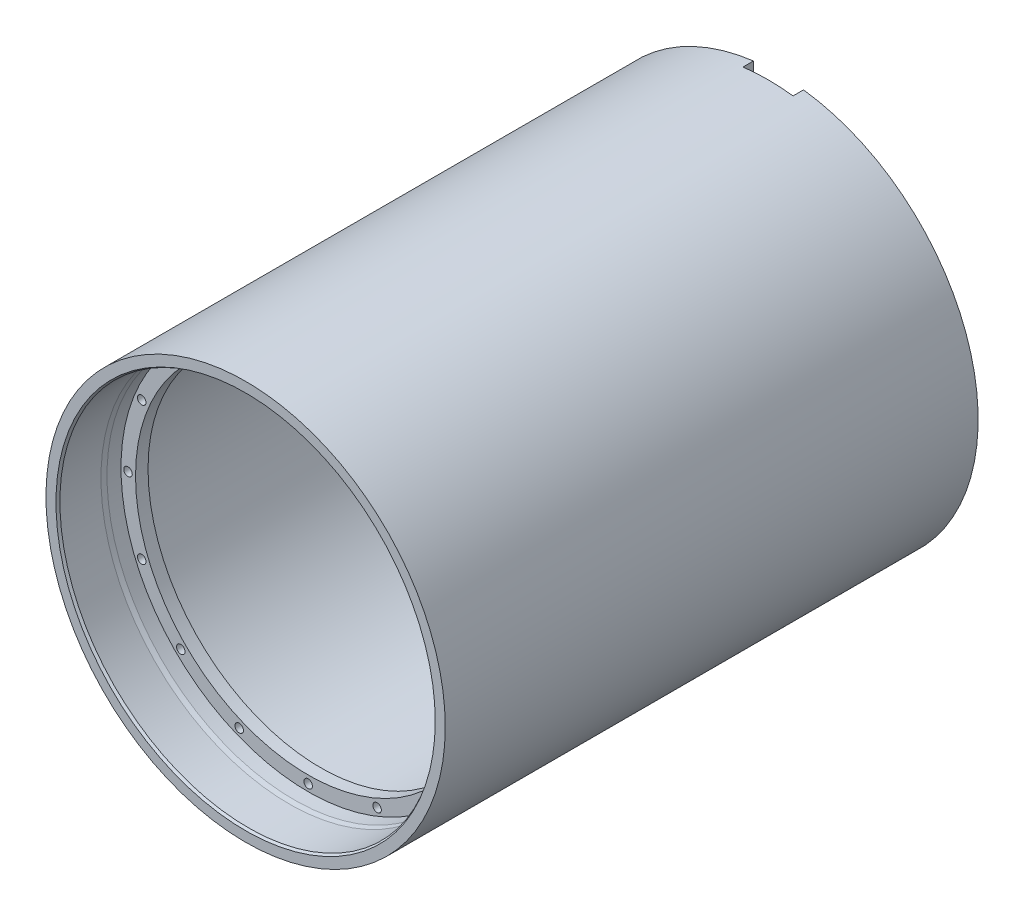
ISO-10303-21;
HEADER;
FILE_DESCRIPTION(('STEP AP214'),'2;1');
FILE_NAME('part.step','',(''),(''),'','','');
FILE_SCHEMA(('AUTOMOTIVE_DESIGN { 1 0 10303 214 1 1 1 1 }'));
ENDSEC;
DATA;
#1=APPLICATION_CONTEXT('core data for automotive mechanical design processes');
#2=APPLICATION_PROTOCOL_DEFINITION('international standard','automotive_design',2000,#1);
#3=PRODUCT_CONTEXT('',#1,'mechanical');
#4=PRODUCT('Part','Part','',(#3));
#5=PRODUCT_RELATED_PRODUCT_CATEGORY('part','',(#4));
#6=PRODUCT_DEFINITION_FORMATION('','',#4);
#7=PRODUCT_DEFINITION_CONTEXT('part definition',#1,'design');
#8=PRODUCT_DEFINITION('design','',#6,#7);
#9=PRODUCT_DEFINITION_SHAPE('','',#8);
#10=(LENGTH_UNIT() NAMED_UNIT(*) SI_UNIT(.MILLI.,.METRE.));
#11=(NAMED_UNIT(*) PLANE_ANGLE_UNIT() SI_UNIT($,.RADIAN.));
#12=(NAMED_UNIT(*) SI_UNIT($,.STERADIAN.) SOLID_ANGLE_UNIT());
#13=UNCERTAINTY_MEASURE_WITH_UNIT(LENGTH_MEASURE(1.E-05),#10,'distance_accuracy_value','');
#14=(GEOMETRIC_REPRESENTATION_CONTEXT(3) GLOBAL_UNCERTAINTY_ASSIGNED_CONTEXT((#13)) GLOBAL_UNIT_ASSIGNED_CONTEXT((#10,
#11,#12)) REPRESENTATION_CONTEXT('',''));
#15=CARTESIAN_POINT('',(0.,0.,0.));
#16=DIRECTION('',(0.,0.,1.));
#17=DIRECTION('',(1.,0.,0.));
#18=AXIS2_PLACEMENT_3D('',#15,#16,#17);
#19=CARTESIAN_POINT('',(0.,0.,0.));
#20=DIRECTION('',(0.,0.,1.));
#21=DIRECTION('',(1.,0.,0.));
#22=AXIS2_PLACEMENT_3D('',#19,#20,#21);
#23=PLANE('',#22);
#24=CARTESIAN_POINT('',(0.,0.,0.));
#25=DIRECTION('',(0.,0.,1.));
#26=DIRECTION('',(1.,0.,0.));
#27=AXIS2_PLACEMENT_3D('',#24,#25,#26);
#28=CIRCLE('',#27,101.346);
#29=CARTESIAN_POINT('',(-12.7,100.54711192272,0.));
#30=VERTEX_POINT('',#29);
#31=CARTESIAN_POINT('',(-12.7,-100.54711192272,0.));
#32=VERTEX_POINT('',#31);
#33=EDGE_CURVE('E157',#30,#32,#28,.T.);
#34=ORIENTED_EDGE('',*,*,#33,.F.);
#35=DIRECTION('',(0.,1.,0.));
#36=VECTOR('',#35,1.);
#37=CARTESIAN_POINT('',(-12.7,-101.346,0.));
#38=LINE('',#37,#36);
#39=CARTESIAN_POINT('',(-12.7,95.193971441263,0.));
#40=VERTEX_POINT('',#39);
#41=EDGE_CURVE('E143',#40,#30,#38,.T.);
#42=ORIENTED_EDGE('',*,*,#41,.F.);
#43=CARTESIAN_POINT('',(0.,0.,0.));
#44=DIRECTION('',(0.,0.,-1.));
#45=DIRECTION('',(-1.,0.,0.));
#46=AXIS2_PLACEMENT_3D('',#43,#44,#45);
#47=CIRCLE('',#46,96.0374);
#48=CARTESIAN_POINT('',(-12.7,-95.193971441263,0.));
#49=VERTEX_POINT('',#48);
#50=EDGE_CURVE('E181',#49,#40,#47,.T.);
#51=ORIENTED_EDGE('',*,*,#50,.F.);
#52=EDGE_CURVE('E234',#32,#49,#38,.T.);
#53=ORIENTED_EDGE('',*,*,#52,.F.);
#54=EDGE_LOOP('',(#34,#42,#51,#53));
#55=FACE_BOUND('',#54,.T.);
#56=ADVANCED_FACE('F43',(#55),#23,.F.);
#57=CARTESIAN_POINT('',(0.,0.,6.34999999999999));
#58=DIRECTION('',(0.,0.,-1.));
#59=DIRECTION('',(-1.,0.,0.));
#60=AXIS2_PLACEMENT_3D('',#57,#58,#59);
#61=CYLINDRICAL_SURFACE('',#60,96.0374);
#62=ORIENTED_EDGE('',*,*,#50,.T.);
#63=DIRECTION('',(0.,0.,-1.));
#64=VECTOR('',#63,1.);
#65=CARTESIAN_POINT('',(-12.7,95.193971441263,6.34999999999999));
#66=LINE('',#65,#64);
#67=CARTESIAN_POINT('',(-12.7,95.193971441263,2.03200000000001));
#68=VERTEX_POINT('',#67);
#69=EDGE_CURVE('E257',#40,#68,#66,.F.);
#70=ORIENTED_EDGE('',*,*,#69,.T.);
#71=CARTESIAN_POINT('',(0.,0.,2.03200000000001));
#72=DIRECTION('',(0.,0.,-1.));
#73=DIRECTION('',(-1.,0.,0.));
#74=AXIS2_PLACEMENT_3D('',#71,#72,#73);
#75=CIRCLE('',#74,96.0374);
#76=CARTESIAN_POINT('',(-12.7,-95.193971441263,2.03199999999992));
#77=VERTEX_POINT('',#76);
#78=EDGE_CURVE('E174',#68,#77,#75,.F.);
#79=ORIENTED_EDGE('',*,*,#78,.T.);
#80=DIRECTION('',(0.,0.,-1.));
#81=VECTOR('',#80,1.);
#82=CARTESIAN_POINT('',(-12.7,-95.193971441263,6.34999999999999));
#83=LINE('',#82,#81);
#84=EDGE_CURVE('E413',#77,#49,#83,.T.);
#85=ORIENTED_EDGE('',*,*,#84,.T.);
#86=EDGE_LOOP('',(#62,#70,#79,#85));
#87=FACE_BOUND('',#86,.T.);
#88=ADVANCED_FACE('F289',(#87),#61,.F.);
#89=CARTESIAN_POINT('',(0.,0.,3.68299999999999));
#90=DIRECTION('',(0.,0.,-1.));
#91=DIRECTION('',(-1.,0.,0.));
#92=AXIS2_PLACEMENT_3D('',#89,#90,#91);
#93=TOROIDAL_SURFACE('',#92,96.0374,1.651);
#94=CARTESIAN_POINT('',(0.,0.,5.334));
#95=DIRECTION('',(0.,0.,-1.));
#96=DIRECTION('',(-1.,0.,0.));
#97=AXIS2_PLACEMENT_3D('',#94,#95,#96);
#98=CIRCLE('',#97,96.0374);
#99=CARTESIAN_POINT('',(-12.7,95.193971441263,5.334));
#100=VERTEX_POINT('',#99);
#101=CARTESIAN_POINT('',(-12.7,-95.193971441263,5.334));
#102=VERTEX_POINT('',#101);
#103=EDGE_CURVE('E183',#100,#102,#98,.F.);
#104=ORIENTED_EDGE('',*,*,#103,.T.);
#105=CARTESIAN_POINT('',(-12.7,-96.695533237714,4.39710093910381));
#106=CARTESIAN_POINT('',(-12.7,-96.7356358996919,4.31420762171));
#107=CARTESIAN_POINT('',(-12.7,-96.7687891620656,4.22788057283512));
#108=CARTESIAN_POINT('',(-12.7,-96.8201627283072,4.05081751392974));
#109=CARTESIAN_POINT('',(-12.7,-96.838366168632,3.96007664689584));
#110=CARTESIAN_POINT('',(-12.7,-96.8592531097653,3.77684917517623));
#111=CARTESIAN_POINT('',(-12.7,-96.8619420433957,3.68436319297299));
#112=CARTESIAN_POINT('',(-12.7,-96.8517292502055,3.50028028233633));
#113=CARTESIAN_POINT('',(-12.7,-96.8388311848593,3.40868315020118));
#114=CARTESIAN_POINT('',(-12.7,-96.7978618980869,3.22906428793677));
#115=CARTESIAN_POINT('',(-12.7,-96.7698088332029,3.14103841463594));
#116=CARTESIAN_POINT('',(-12.7,-96.6993694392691,2.97092021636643));
#117=CARTESIAN_POINT('',(-12.7,-96.6569824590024,2.88882816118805));
#118=CARTESIAN_POINT('',(-12.7,-96.558950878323,2.73260349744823));
#119=CARTESIAN_POINT('',(-12.7,-96.5032625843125,2.65849831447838));
#120=CARTESIAN_POINT('',(-12.7,-96.3803186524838,2.5206034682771));
#121=CARTESIAN_POINT('',(-12.7,-96.3130626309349,2.45681414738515));
#122=CARTESIAN_POINT('',(-12.7,-96.1683709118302,2.34085479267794));
#123=CARTESIAN_POINT('',(-12.7,-96.0908641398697,2.28877345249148));
#124=CARTESIAN_POINT('',(-12.7,-95.9282642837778,2.19823725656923));
#125=CARTESIAN_POINT('',(-12.7,-95.843170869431,2.15978299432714));
#126=CARTESIAN_POINT('',(-12.7,-95.6670563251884,2.09726517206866));
#127=CARTESIAN_POINT('',(-12.7,-95.5759919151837,2.07332351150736));
#128=CARTESIAN_POINT('',(-12.7,-95.3911441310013,2.04097105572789));
#129=CARTESIAN_POINT('',(-12.7,-95.2973606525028,2.03256085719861));
#130=CARTESIAN_POINT('',(-12.7,-95.1091644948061,2.03149047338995));
#131=CARTESIAN_POINT('',(-12.7,-95.0147512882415,2.03892076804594));
#132=CARTESIAN_POINT('',(-12.7,-94.8285076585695,2.06951477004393));
#133=CARTESIAN_POINT('',(-12.7,-94.736677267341,2.09267867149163));
#134=CARTESIAN_POINT('',(-12.7,-94.5581617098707,2.15413205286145));
#135=CARTESIAN_POINT('',(-12.7,-94.471479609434,2.19243044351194));
#136=CARTESIAN_POINT('',(-12.7,-94.3058195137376,2.28310654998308));
#137=CARTESIAN_POINT('',(-12.7,-94.226841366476,2.33548398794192));
#138=CARTESIAN_POINT('',(-12.7,-94.079270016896,2.45257188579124));
#139=CARTESIAN_POINT('',(-12.7,-94.0106269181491,2.51721944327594));
#140=CARTESIAN_POINT('',(-12.7,-93.8852821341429,2.65720867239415));
#141=CARTESIAN_POINT('',(-12.7,-93.8285799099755,2.73254986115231));
#142=CARTESIAN_POINT('',(-12.7,-93.7292423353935,2.89110548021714));
#143=CARTESIAN_POINT('',(-12.7,-93.6864917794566,2.97424773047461));
#144=CARTESIAN_POINT('',(-12.7,-93.6156875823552,3.1465710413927));
#145=CARTESIAN_POINT('',(-12.7,-93.5876332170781,3.2357518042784));
#146=CARTESIAN_POINT('',(-12.7,-93.5472381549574,3.41684058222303));
#147=CARTESIAN_POINT('',(-12.7,-93.5347715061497,3.50872051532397));
#148=CARTESIAN_POINT('',(-12.7,-93.5255098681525,3.69326572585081));
#149=CARTESIAN_POINT('',(-12.7,-93.5287144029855,3.785930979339));
#150=CARTESIAN_POINT('',(-12.7,-93.5506526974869,3.96902265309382));
#151=CARTESIAN_POINT('',(-12.7,-93.5693237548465,4.05945659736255));
#152=CARTESIAN_POINT('',(-12.7,-93.6215558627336,4.23591511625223));
#153=CARTESIAN_POINT('',(-12.7,-93.6551169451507,4.32193968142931));
#154=CARTESIAN_POINT('',(-12.7,-93.7362144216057,4.48732799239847));
#155=CARTESIAN_POINT('',(-12.7,-93.7837772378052,4.56667877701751));
#156=CARTESIAN_POINT('',(-12.7,-93.8914632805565,4.71634045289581));
#157=CARTESIAN_POINT('',(-12.7,-93.9515868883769,4.78665106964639));
#158=CARTESIAN_POINT('',(-12.7,-94.0831213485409,4.916766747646));
#159=CARTESIAN_POINT('',(-12.7,-94.1546073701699,4.97649580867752));
#160=CARTESIAN_POINT('',(-12.7,-94.3065186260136,5.08322968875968));
#161=CARTESIAN_POINT('',(-12.7,-94.386944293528,5.13023389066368));
#162=CARTESIAN_POINT('',(-12.7,-94.5552096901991,5.21061535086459));
#163=CARTESIAN_POINT('',(-12.7,-94.6431083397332,5.24386928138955));
#164=CARTESIAN_POINT('',(-12.7,-94.8232193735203,5.2952606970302));
#165=CARTESIAN_POINT('',(-12.7,-94.9154319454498,5.31339752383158));
#166=CARTESIAN_POINT('',(-12.7,-95.102223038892,5.33414077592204));
#167=CARTESIAN_POINT('',(-12.7,-95.1968133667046,5.33664101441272));
#168=CARTESIAN_POINT('',(-12.7,-95.3850738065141,5.32575804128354));
#169=CARTESIAN_POINT('',(-12.7,-95.4787439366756,5.31237514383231));
#170=CARTESIAN_POINT('',(-12.7,-95.6626712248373,5.27004726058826));
#171=CARTESIAN_POINT('',(-12.7,-95.7529222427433,5.24107557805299));
#172=CARTESIAN_POINT('',(-12.7,-95.9272759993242,5.16832537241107));
#173=CARTESIAN_POINT('',(-12.7,-96.0113772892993,5.12454337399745));
#174=CARTESIAN_POINT('',(-12.7,-96.170690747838,5.02355883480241));
#175=CARTESIAN_POINT('',(-12.7,-96.245931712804,4.96640168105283));
#176=CARTESIAN_POINT('',(-12.7,-96.3855824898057,4.84021490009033));
#177=CARTESIAN_POINT('',(-12.7,-96.4500056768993,4.77120015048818));
#178=CARTESIAN_POINT('',(-12.7,-96.5445785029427,4.6507829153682));
#179=CARTESIAN_POINT('',(-12.7,-96.5785748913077,4.60234917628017));
#180=CARTESIAN_POINT('',(-12.7,-96.6411799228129,4.50211563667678));
#181=CARTESIAN_POINT('',(-12.7,-96.669788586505,4.45031584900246));
#182=CARTESIAN_POINT('',(-12.7,-96.695533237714,4.39710093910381));
#183=B_SPLINE_CURVE_WITH_KNOTS('',3,(#105,#106,#107,#108,#109,#110,#111,#112,#113,#114,#115,
#116,#117,#118,#119,#120,#121,#122,#123,#124,#125,#126,#127,#128,#129,#130,#131,#132,#133,#134,
#135,#136,#137,#138,#139,#140,#141,#142,#143,#144,#145,#146,#147,#148,#149,#150,#151,#152,#153,
#154,#155,#156,#157,#158,#159,#160,#161,#162,#163,#164,#165,#166,#167,#168,#169,#170,#171,#172,
#173,#174,#175,#176,#177,#178,#179,#180,#181,#182),.UNSPECIFIED.,.T.,.F.,(4,2,2,2,2,2,2,2,2,2,2,
2,2,2,2,2,2,2,2,2,2,2,2,2,2,2,2,2,2,2,2,2,2,2,2,2,2,2,4),(0.,0.27603831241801,0.552387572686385,
0.828640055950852,1.10482765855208,1.38068510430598,1.65655508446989,1.933344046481,
2.2101421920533,2.48897140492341,2.76781276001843,3.04896492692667,3.33012789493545,
3.61290115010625,3.89567789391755,4.17862137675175,4.46155927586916,4.74308407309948,
5.02459616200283,5.30372111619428,5.58283231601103,5.85967335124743,6.13650597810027,
6.41222176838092,6.68793814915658,6.96417819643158,7.24042662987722,7.51858513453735,
7.79675712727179,8.07737261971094,8.35800033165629,8.64053171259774,8.92305750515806,
9.20606868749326,9.48914632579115,9.77127695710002,10.0530561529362,10.2302647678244,
10.4074727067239),.UNSPECIFIED.);
#184=CARTESIAN_POINT('',(-12.7,-96.8593490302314,3.68299999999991));
#185=VERTEX_POINT('',#184);
#186=EDGE_CURVE('E419',#102,#185,#183,.T.);
#187=ORIENTED_EDGE('',*,*,#186,.T.);
#188=CARTESIAN_POINT('',(0.,0.,3.68299999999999));
#189=DIRECTION('',(0.,0.,-1.));
#190=DIRECTION('',(-1.,0.,0.));
#191=AXIS2_PLACEMENT_3D('',#188,#189,#190);
#192=CIRCLE('',#191,97.6884);
#193=CARTESIAN_POINT('',(-12.7,96.8593490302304,3.68299999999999));
#194=VERTEX_POINT('',#193);
#195=EDGE_CURVE('E196',#194,#185,#192,.F.);
#196=ORIENTED_EDGE('',*,*,#195,.F.);
#197=CARTESIAN_POINT('',(-12.7,93.785137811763,4.56402794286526));
#198=CARTESIAN_POINT('',(-12.7,93.73563320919,4.48627385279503));
#199=CARTESIAN_POINT('',(-12.7,93.6926286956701,4.4043055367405));
#200=CARTESIAN_POINT('',(-12.7,93.6209436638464,4.23425153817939));
#201=CARTESIAN_POINT('',(-12.7,93.5922790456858,4.14615918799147));
#202=CARTESIAN_POINT('',(-12.7,93.5501812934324,3.96642138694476));
#203=CARTESIAN_POINT('',(-12.7,93.5367442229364,3.8747768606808));
#204=CARTESIAN_POINT('',(-12.7,93.525501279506,3.69055706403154));
#205=CARTESIAN_POINT('',(-12.7,93.5276916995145,3.59798201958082));
#206=CARTESIAN_POINT('',(-12.7,93.5475993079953,3.41477520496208));
#207=CARTESIAN_POINT('',(-12.7,93.5652738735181,3.32413879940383));
#208=CARTESIAN_POINT('',(-12.7,93.6155647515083,3.14710950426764));
#209=CARTESIAN_POINT('',(-12.7,93.6481816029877,3.06071676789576));
#210=CARTESIAN_POINT('',(-12.7,93.7274592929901,2.89445836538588));
#211=CARTESIAN_POINT('',(-12.7,93.7741437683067,2.81460397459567));
#212=CARTESIAN_POINT('',(-12.7,93.8801709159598,2.66379713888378));
#213=CARTESIAN_POINT('',(-12.7,93.9395139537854,2.59284495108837));
#214=CARTESIAN_POINT('',(-12.7,94.0695931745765,2.461330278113));
#215=CARTESIAN_POINT('',(-12.7,94.1404040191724,2.40084165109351));
#216=CARTESIAN_POINT('',(-12.7,94.2911004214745,2.29248717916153));
#217=CARTESIAN_POINT('',(-12.7,94.3709863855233,2.24462189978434));
#218=CARTESIAN_POINT('',(-12.7,94.5383183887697,2.16243199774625));
#219=CARTESIAN_POINT('',(-12.7,94.6258246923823,2.12823005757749));
#220=CARTESIAN_POINT('',(-12.7,94.8053140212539,2.07488857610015));
#221=CARTESIAN_POINT('',(-12.7,94.8972972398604,2.05574968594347));
#222=CARTESIAN_POINT('',(-12.7,95.0838080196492,2.03296666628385));
#223=CARTESIAN_POINT('',(-12.7,95.1783487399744,2.02943014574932));
#224=CARTESIAN_POINT('',(-12.7,95.3666882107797,2.03824351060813));
#225=CARTESIAN_POINT('',(-12.7,95.4604869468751,2.05059370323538));
#226=CARTESIAN_POINT('',(-12.7,95.6448717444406,2.09089301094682));
#227=CARTESIAN_POINT('',(-12.7,95.7354509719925,2.11887341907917));
#228=CARTESIAN_POINT('',(-12.7,95.9106009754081,2.18969843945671));
#229=CARTESIAN_POINT('',(-12.7,95.9951718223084,2.23254287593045));
#230=CARTESIAN_POINT('',(-12.7,96.1555577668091,2.33173657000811));
#231=CARTESIAN_POINT('',(-12.7,96.2314037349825,2.3880358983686));
#232=CARTESIAN_POINT('',(-12.7,96.3724754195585,2.51265895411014));
#233=CARTESIAN_POINT('',(-12.7,96.4377015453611,2.58098221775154));
#234=CARTESIAN_POINT('',(-12.7,96.55514433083,2.72716154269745));
#235=CARTESIAN_POINT('',(-12.7,96.6074563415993,2.8049409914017));
#236=CARTESIAN_POINT('',(-12.7,96.6981529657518,2.96823601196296));
#237=CARTESIAN_POINT('',(-12.7,96.7365382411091,3.05375121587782));
#238=CARTESIAN_POINT('',(-12.7,96.797970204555,3.2293341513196));
#239=CARTESIAN_POINT('',(-12.7,96.8211403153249,3.31935871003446));
#240=CARTESIAN_POINT('',(-12.7,96.8519479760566,3.50202675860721));
#241=CARTESIAN_POINT('',(-12.7,96.8595860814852,3.59467015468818));
#242=CARTESIAN_POINT('',(-12.7,96.8591020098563,3.77942377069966));
#243=CARTESIAN_POINT('',(-12.7,96.8510629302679,3.87153422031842));
#244=CARTESIAN_POINT('',(-12.7,96.8196303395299,4.05309534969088));
#245=CARTESIAN_POINT('',(-12.7,96.7962369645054,4.14254605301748));
#246=CARTESIAN_POINT('',(-12.7,96.734795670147,4.31624486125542));
#247=CARTESIAN_POINT('',(-12.7,96.6967502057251,4.4004938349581));
#248=CARTESIAN_POINT('',(-12.7,96.6071225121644,4.56145178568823));
#249=CARTESIAN_POINT('',(-12.7,96.5555400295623,4.63816062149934));
#250=CARTESIAN_POINT('',(-12.7,96.440045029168,4.78228300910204));
#251=CARTESIAN_POINT('',(-12.7,96.3760724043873,4.8496483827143));
#252=CARTESIAN_POINT('',(-12.7,96.2378056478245,4.97278789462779));
#253=CARTESIAN_POINT('',(-12.7,96.1635110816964,5.02856154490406));
#254=CARTESIAN_POINT('',(-12.7,96.006071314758,5.12741494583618));
#255=CARTESIAN_POINT('',(-12.7,95.9228596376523,5.17038881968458));
#256=CARTESIAN_POINT('',(-12.7,95.7504423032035,5.24188063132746));
#257=CARTESIAN_POINT('',(-12.7,95.6612363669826,5.27039789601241));
#258=CARTESIAN_POINT('',(-12.7,95.4786159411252,5.31238393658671));
#259=CARTESIAN_POINT('',(-12.7,95.3851740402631,5.32573353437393));
#260=CARTESIAN_POINT('',(-12.7,95.1973758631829,5.33662714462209));
#261=CARTESIAN_POINT('',(-12.7,95.1030195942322,5.33417128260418));
#262=CARTESIAN_POINT('',(-12.7,94.9156633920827,5.31348078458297));
#263=CARTESIAN_POINT('',(-12.7,94.822670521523,5.2951821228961));
#264=CARTESIAN_POINT('',(-12.7,94.641057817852,5.24320504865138));
#265=CARTESIAN_POINT('',(-12.7,94.5524390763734,5.2095228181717));
#266=CARTESIAN_POINT('',(-12.7,94.3822326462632,5.1277428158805));
#267=CARTESIAN_POINT('',(-12.7,94.3006384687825,5.07965853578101));
#268=CARTESIAN_POINT('',(-12.7,94.1468274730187,4.97041811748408));
#269=CARTESIAN_POINT('',(-12.7,94.0745992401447,4.90927813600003));
#270=CARTESIAN_POINT('',(-12.7,93.9660763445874,4.80027676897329));
#271=CARTESIAN_POINT('',(-12.7,93.9263313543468,4.75579354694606));
#272=CARTESIAN_POINT('',(-12.7,93.8518645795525,4.6628033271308));
#273=CARTESIAN_POINT('',(-12.7,93.8171427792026,4.61429634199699));
#274=CARTESIAN_POINT('',(-12.7,93.785137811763,4.56402794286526));
#275=B_SPLINE_CURVE_WITH_KNOTS('',3,(#197,#198,#199,#200,#201,#202,#203,#204,#205,#206,#207,
#208,#209,#210,#211,#212,#213,#214,#215,#216,#217,#218,#219,#220,#221,#222,#223,#224,#225,#226,
#227,#228,#229,#230,#231,#232,#233,#234,#235,#236,#237,#238,#239,#240,#241,#242,#243,#244,#245,
#246,#247,#248,#249,#250,#251,#252,#253,#254,#255,#256,#257,#258,#259,#260,#261,#262,#263,#264,
#265,#266,#267,#268,#269,#270,#271,#272,#273,#274),.UNSPECIFIED.,.T.,.F.,(4,2,2,2,2,2,2,2,2,2,2,
2,2,2,2,2,2,2,2,2,2,2,2,2,2,2,2,2,2,2,2,2,2,2,2,2,2,2,4),(0.,0.276311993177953,
0.552929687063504,0.829475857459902,1.10595642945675,1.3816783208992,1.65741015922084,
1.93360789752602,2.20981361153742,2.48789575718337,2.76599035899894,3.04652867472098,
3.3270791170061,3.60956151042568,3.89204936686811,4.17510482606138,4.45815693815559,
4.7401745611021,5.02218130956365,5.30203901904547,5.58188342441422,5.85942878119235,
6.13696421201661,6.41303255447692,6.68909844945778,6.96511811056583,7.24114294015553,
7.51854196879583,7.7959526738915,8.07559809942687,8.35525654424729,8.63709749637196,
8.91893621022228,9.20191926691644,9.48497259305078,9.76776158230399,10.050202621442,
10.2288402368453,10.4074772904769),.UNSPECIFIED.);
#276=EDGE_CURVE('E152',#194,#100,#275,.T.);
#277=ORIENTED_EDGE('',*,*,#276,.T.);
#278=EDGE_LOOP('',(#104,#187,#196,#277));
#279=FACE_BOUND('',#278,.T.);
#280=ADVANCED_FACE('F243',(#279),#93,.F.);
#281=CARTESIAN_POINT('',(0.,0.,3.68299999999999));
#282=DIRECTION('',(0.,0.,-1.));
#283=DIRECTION('',(-1.,0.,0.));
#284=AXIS2_PLACEMENT_3D('',#281,#282,#283);
#285=TOROIDAL_SURFACE('',#284,96.0374,1.651);
#286=ORIENTED_EDGE('',*,*,#195,.T.);
#287=CARTESIAN_POINT('',(-12.7,-96.5467592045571,2.72002117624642));
#288=CARTESIAN_POINT('',(-12.7,-96.4919996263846,2.64442015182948));
#289=CARTESIAN_POINT('',(-12.7,-96.4307718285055,2.57341577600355));
#290=CARTESIAN_POINT('',(-12.7,-96.2971882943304,2.44266156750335));
#291=CARTESIAN_POINT('',(-12.7,-96.2248181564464,2.38292652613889));
#292=CARTESIAN_POINT('',(-12.7,-96.0711489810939,2.27647214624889));
#293=CARTESIAN_POINT('',(-12.7,-95.9898574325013,2.22974200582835));
#294=CARTESIAN_POINT('',(-12.7,-95.8206428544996,2.15051430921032));
#295=CARTESIAN_POINT('',(-12.7,-95.7327214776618,2.11801321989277));
#296=CARTESIAN_POINT('',(-12.7,-95.5521588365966,2.0679378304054));
#297=CARTESIAN_POINT('',(-12.7,-95.4594925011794,2.05045391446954));
#298=CARTESIAN_POINT('',(-12.7,-95.2725364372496,2.03120816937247));
#299=CARTESIAN_POINT('',(-12.7,-95.1782465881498,2.02944751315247));
#300=CARTESIAN_POINT('',(-12.7,-94.9902450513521,2.04172495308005));
#301=CARTESIAN_POINT('',(-12.7,-94.896538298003,2.05583878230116));
#302=CARTESIAN_POINT('',(-12.7,-94.7128252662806,2.09960649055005));
#303=CARTESIAN_POINT('',(-12.7,-94.6228190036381,2.12926043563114));
#304=CARTESIAN_POINT('',(-12.7,-94.4491384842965,2.20327972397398));
#305=CARTESIAN_POINT('',(-12.7,-94.3654602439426,2.24763571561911));
#306=CARTESIAN_POINT('',(-12.7,-94.2067977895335,2.34984682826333));
#307=CARTESIAN_POINT('',(-12.7,-94.1318133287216,2.40770156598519));
#308=CARTESIAN_POINT('',(-12.7,-93.9931619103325,2.53491370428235));
#309=CARTESIAN_POINT('',(-12.7,-93.929429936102,2.60420022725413));
#310=CARTESIAN_POINT('',(-12.7,-93.8146266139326,2.75257117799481));
#311=CARTESIAN_POINT('',(-12.7,-93.7635546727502,2.83165514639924));
#312=CARTESIAN_POINT('',(-12.7,-93.6759959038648,2.99663394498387));
#313=CARTESIAN_POINT('',(-12.7,-93.6393853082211,3.08246309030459));
#314=CARTESIAN_POINT('',(-12.7,-93.5812180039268,3.25907906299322));
#315=CARTESIAN_POINT('',(-12.7,-93.5596605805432,3.34986565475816));
#316=CARTESIAN_POINT('',(-12.7,-93.5323572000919,3.53308425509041));
#317=CARTESIAN_POINT('',(-12.7,-93.5264932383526,3.62549869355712));
#318=CARTESIAN_POINT('',(-12.7,-93.5304128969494,3.80999379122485));
#319=CARTESIAN_POINT('',(-12.7,-93.5401961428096,3.90207445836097));
#320=CARTESIAN_POINT('',(-12.7,-93.5750649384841,4.08301658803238));
#321=CARTESIAN_POINT('',(-12.7,-93.6001068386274,4.17188647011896));
#322=CARTESIAN_POINT('',(-12.7,-93.6647100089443,4.34418000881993));
#323=CARTESIAN_POINT('',(-12.7,-93.7042714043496,4.42760361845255));
#324=CARTESIAN_POINT('',(-12.7,-93.7968961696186,4.58693128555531));
#325=CARTESIAN_POINT('',(-12.7,-93.8500013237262,4.66281104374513));
#326=CARTESIAN_POINT('',(-12.7,-93.9681075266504,4.8046639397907));
#327=CARTESIAN_POINT('',(-12.7,-94.0331090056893,4.8706367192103));
#328=CARTESIAN_POINT('',(-12.7,-94.1736852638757,4.99134750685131));
#329=CARTESIAN_POINT('',(-12.7,-94.249336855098,5.04599605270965));
#330=CARTESIAN_POINT('',(-12.7,-94.4086767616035,5.14194548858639));
#331=CARTESIAN_POINT('',(-12.7,-94.4923654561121,5.18324574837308));
#332=CARTESIAN_POINT('',(-12.7,-94.6661838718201,5.25169471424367));
#333=CARTESIAN_POINT('',(-12.7,-94.7563631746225,5.27871753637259));
#334=CARTESIAN_POINT('',(-12.7,-94.9399668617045,5.31733979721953));
#335=CARTESIAN_POINT('',(-12.7,-95.0333913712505,5.32893863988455));
#336=CARTESIAN_POINT('',(-12.7,-95.2214226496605,5.33642359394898));
#337=CARTESIAN_POINT('',(-12.7,-95.3160331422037,5.33221650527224));
#338=CARTESIAN_POINT('',(-12.7,-95.50320916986,5.30799035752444));
#339=CARTESIAN_POINT('',(-12.7,-95.5957746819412,5.28797112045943));
#340=CARTESIAN_POINT('',(-12.7,-95.7762807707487,5.23264091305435));
#341=CARTESIAN_POINT('',(-12.7,-95.8642185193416,5.19732071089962));
#342=CARTESIAN_POINT('',(-12.7,-96.03287567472,5.11234823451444));
#343=CARTESIAN_POINT('',(-12.7,-96.113595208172,5.06269621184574));
#344=CARTESIAN_POINT('',(-12.7,-96.2650893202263,4.95070833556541));
#345=CARTESIAN_POINT('',(-12.7,-96.3359103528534,4.88843533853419));
#346=CARTESIAN_POINT('',(-12.7,-96.4659868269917,4.75279591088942));
#347=CARTESIAN_POINT('',(-12.7,-96.525242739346,4.67942993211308));
#348=CARTESIAN_POINT('',(-12.7,-96.6299925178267,4.5243211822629));
#349=CARTESIAN_POINT('',(-12.7,-96.6755938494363,4.44265098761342));
#350=CARTESIAN_POINT('',(-12.7,-96.7523114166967,4.27277276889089));
#351=CARTESIAN_POINT('',(-12.7,-96.783428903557,4.18456531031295));
#352=CARTESIAN_POINT('',(-12.7,-96.8300575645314,4.0048639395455));
#353=CARTESIAN_POINT('',(-12.7,-96.8456901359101,3.91340151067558));
#354=CARTESIAN_POINT('',(-12.7,-96.861309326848,3.72912569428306));
#355=CARTESIAN_POINT('',(-12.7,-96.8612924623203,3.6363120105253));
#356=CARTESIAN_POINT('',(-12.7,-96.8456396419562,3.45236708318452));
#357=CARTESIAN_POINT('',(-12.7,-96.830061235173,3.36123090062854));
#358=CARTESIAN_POINT('',(-12.7,-96.7838415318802,3.18294472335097));
#359=CARTESIAN_POINT('',(-12.7,-96.7532186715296,3.09578999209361));
#360=CARTESIAN_POINT('',(-12.7,-96.6925134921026,2.96049398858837));
#361=CARTESIAN_POINT('',(-12.7,-96.6668281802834,2.910331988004));
#362=CARTESIAN_POINT('',(-12.7,-96.6104660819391,2.81289625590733));
#363=CARTESIAN_POINT('',(-12.7,-96.5797893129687,2.76562251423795));
#364=CARTESIAN_POINT('',(-12.7,-96.5467592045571,2.72002117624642));
#365=B_SPLINE_CURVE_WITH_KNOTS('',3,(#287,#288,#289,#290,#291,#292,#293,#294,#295,#296,#297,
#298,#299,#300,#301,#302,#303,#304,#305,#306,#307,#308,#309,#310,#311,#312,#313,#314,#315,#316,
#317,#318,#319,#320,#321,#322,#323,#324,#325,#326,#327,#328,#329,#330,#331,#332,#333,#334,#335,
#336,#337,#338,#339,#340,#341,#342,#343,#344,#345,#346,#347,#348,#349,#350,#351,#352,#353,#354,
#355,#356,#357,#358,#359,#360,#361,#362,#363,#364),.UNSPECIFIED.,.T.,.F.,(4,2,2,2,2,2,2,2,2,2,2,
2,2,2,2,2,2,2,2,2,2,2,2,2,2,2,2,2,2,2,2,2,2,2,2,2,2,2,4),(0.,0.279840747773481,
0.560046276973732,0.840018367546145,1.11992090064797,1.40149651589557,1.68309313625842,
1.96603890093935,2.2489858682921,2.53175320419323,2.81451251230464,3.09558039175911,
3.37663509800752,3.65522937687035,3.93381042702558,4.21029076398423,4.48676448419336,
4.76245099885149,5.03813989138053,5.31468983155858,5.5912497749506,5.86991761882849,
6.14859861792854,6.42969738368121,6.71080701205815,6.99357680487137,7.27634978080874,
7.55929360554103,7.84223246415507,8.12379537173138,8.40534681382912,8.68462031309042,
8.96386968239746,9.24091206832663,9.51801613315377,9.79409920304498,10.0698447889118,
10.2386408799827,10.4074363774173),.UNSPECIFIED.);
#366=EDGE_CURVE('E273',#185,#77,#365,.T.);
#367=ORIENTED_EDGE('',*,*,#366,.T.);
#368=ORIENTED_EDGE('',*,*,#78,.F.);
#369=CARTESIAN_POINT('',(-12.7,93.9825344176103,2.54976987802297));
#370=CARTESIAN_POINT('',(-12.7,94.0471559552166,2.4819259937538));
#371=CARTESIAN_POINT('',(-12.7,94.1175934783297,2.41952224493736));
#372=CARTESIAN_POINT('',(-12.7,94.2680233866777,2.30739852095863));
#373=CARTESIAN_POINT('',(-12.7,94.3480282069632,2.25769532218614));
#374=CARTESIAN_POINT('',(-12.7,94.5151745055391,2.17243185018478));
#375=CARTESIAN_POINT('',(-12.7,94.6023101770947,2.13686020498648));
#376=CARTESIAN_POINT('',(-12.7,94.7812705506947,2.08077626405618));
#377=CARTESIAN_POINT('',(-12.7,94.8730940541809,2.06026013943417));
#378=CARTESIAN_POINT('',(-12.7,95.0593625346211,2.03475024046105));
#379=CARTESIAN_POINT('',(-12.7,95.1538186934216,2.02983804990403));
#380=CARTESIAN_POINT('',(-12.7,95.3422253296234,2.03590099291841));
#381=CARTESIAN_POINT('',(-12.7,95.4361757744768,2.04687713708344));
#382=CARTESIAN_POINT('',(-12.7,95.6211158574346,2.08446922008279));
#383=CARTESIAN_POINT('',(-12.7,95.7120983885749,2.111120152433));
#384=CARTESIAN_POINT('',(-12.7,95.8882747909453,2.17936960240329));
#385=CARTESIAN_POINT('',(-12.7,95.9734687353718,2.22096793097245));
#386=CARTESIAN_POINT('',(-12.7,96.135321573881,2.31780405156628));
#387=CARTESIAN_POINT('',(-12.7,96.2120087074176,2.37299462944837));
#388=CARTESIAN_POINT('',(-12.7,96.3549394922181,2.49555706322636));
#389=CARTESIAN_POINT('',(-12.7,96.4211835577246,2.56292843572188));
#390=CARTESIAN_POINT('',(-12.7,96.5408089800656,2.70740436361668));
#391=CARTESIAN_POINT('',(-12.7,96.5942832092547,2.78443201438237));
#392=CARTESIAN_POINT('',(-12.7,96.6874141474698,2.94643159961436));
#393=CARTESIAN_POINT('',(-12.7,96.7270714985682,3.03140316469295));
#394=CARTESIAN_POINT('',(-12.7,96.7911069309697,3.20612240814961));
#395=CARTESIAN_POINT('',(-12.7,96.8156086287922,3.29582478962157));
#396=CARTESIAN_POINT('',(-12.7,96.849111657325,3.47807825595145));
#397=CARTESIAN_POINT('',(-12.7,96.8581135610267,3.57062923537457));
#398=CARTESIAN_POINT('',(-12.7,96.8603406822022,3.75541207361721));
#399=CARTESIAN_POINT('',(-12.7,96.8536519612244,3.84764290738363));
#400=CARTESIAN_POINT('',(-12.7,96.8248768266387,4.02966892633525));
#401=CARTESIAN_POINT('',(-12.7,96.8027905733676,4.11946413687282));
#402=CARTESIAN_POINT('',(-12.7,96.7438889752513,4.294042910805));
#403=CARTESIAN_POINT('',(-12.7,96.7070796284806,4.37882849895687));
#404=CARTESIAN_POINT('',(-12.7,96.6198144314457,4.54105693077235));
#405=CARTESIAN_POINT('',(-12.7,96.5693583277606,4.61849963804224));
#406=CARTESIAN_POINT('',(-12.7,96.455991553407,4.76425426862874));
#407=CARTESIAN_POINT('',(-12.7,96.3930224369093,4.83252072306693));
#408=CARTESIAN_POINT('',(-12.7,96.2565980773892,4.95761578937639));
#409=CARTESIAN_POINT('',(-12.7,96.1831424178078,5.01444394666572));
#410=CARTESIAN_POINT('',(-12.7,96.0272049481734,5.1155357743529));
#411=CARTESIAN_POINT('',(-12.7,95.9446557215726,5.15969544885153));
#412=CARTESIAN_POINT('',(-12.7,95.7733572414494,5.23365380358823));
#413=CARTESIAN_POINT('',(-12.7,95.6846077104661,5.26345184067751));
#414=CARTESIAN_POINT('',(-12.7,95.5026781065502,5.30807199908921));
#415=CARTESIAN_POINT('',(-12.7,95.409468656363,5.32277438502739));
#416=CARTESIAN_POINT('',(-12.7,95.2219024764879,5.33639758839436));
#417=CARTESIAN_POINT('',(-12.7,95.1275457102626,5.33531790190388));
#418=CARTESIAN_POINT('',(-12.7,94.9399269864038,5.31736765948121));
#419=CARTESIAN_POINT('',(-12.7,94.8466716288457,5.30042800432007));
#420=CARTESIAN_POINT('',(-12.7,94.66433257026,5.25111620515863));
#421=CARTESIAN_POINT('',(-12.7,94.5752488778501,5.2187440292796));
#422=CARTESIAN_POINT('',(-12.7,94.4039085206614,5.1394940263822));
#423=CARTESIAN_POINT('',(-12.7,94.3216440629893,5.09263305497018));
#424=CARTESIAN_POINT('',(-12.7,94.1662160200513,4.98568140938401));
#425=CARTESIAN_POINT('',(-12.7,94.0930521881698,4.92559109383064));
#426=CARTESIAN_POINT('',(-12.7,93.9584152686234,4.79428190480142));
#427=CARTESIAN_POINT('',(-12.7,93.8968706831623,4.72313635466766));
#428=CARTESIAN_POINT('',(-12.7,93.7867265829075,4.57144423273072));
#429=CARTESIAN_POINT('',(-12.7,93.7381264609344,4.49089810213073));
#430=CARTESIAN_POINT('',(-12.7,93.6557025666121,4.32345170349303));
#431=CARTESIAN_POINT('',(-12.7,93.6217525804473,4.23661355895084));
#432=CARTESIAN_POINT('',(-12.7,93.569035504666,4.05844887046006));
#433=CARTESIAN_POINT('',(-12.7,93.5502671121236,3.96712271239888));
#434=CARTESIAN_POINT('',(-12.7,93.5285596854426,3.78329093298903));
#435=CARTESIAN_POINT('',(-12.7,93.5255054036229,3.69079890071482));
#436=CARTESIAN_POINT('',(-12.7,93.5350096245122,3.5065962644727));
#437=CARTESIAN_POINT('',(-12.7,93.5475717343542,3.41488584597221));
#438=CARTESIAN_POINT('',(-12.7,93.5878922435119,3.23505832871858));
#439=CARTESIAN_POINT('',(-12.7,93.6156226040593,3.14693492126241));
#440=CARTESIAN_POINT('',(-12.7,93.6854215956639,2.97665014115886));
#441=CARTESIAN_POINT('',(-12.7,93.7274729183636,2.89448171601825));
#442=CARTESIAN_POINT('',(-12.7,93.8057868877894,2.76861561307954));
#443=CARTESIAN_POINT('',(-12.7,93.8379878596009,2.72233970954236));
#444=CARTESIAN_POINT('',(-12.7,93.9069366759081,2.63331042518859));
#445=CARTESIAN_POINT('',(-12.7,93.943684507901,2.59055703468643));
#446=CARTESIAN_POINT('',(-12.7,93.9825344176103,2.54976987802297));
#447=B_SPLINE_CURVE_WITH_KNOTS('',3,(#369,#370,#371,#372,#373,#374,#375,#376,#377,#378,#379,
#380,#381,#382,#383,#384,#385,#386,#387,#388,#389,#390,#391,#392,#393,#394,#395,#396,#397,#398,
#399,#400,#401,#402,#403,#404,#405,#406,#407,#408,#409,#410,#411,#412,#413,#414,#415,#416,#417,
#418,#419,#420,#421,#422,#423,#424,#425,#426,#427,#428,#429,#430,#431,#432,#433,#434,#435,#436,
#437,#438,#439,#440,#441,#442,#443,#444,#445,#446),.UNSPECIFIED.,.T.,.F.,(4,2,2,2,2,2,2,2,2,2,2,
2,2,2,2,2,2,2,2,2,2,2,2,2,2,2,2,2,2,2,2,2,2,2,2,2,2,2,4),(0.,0.280877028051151,
0.562123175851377,0.843142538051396,1.12409040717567,1.40650479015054,1.68893713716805,
1.97200241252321,2.25506410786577,2.53715609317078,2.81923688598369,3.09919902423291,
3.37914815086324,3.65678268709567,3.93440695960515,4.2105120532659,4.48661427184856,
4.76260412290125,5.03859909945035,5.31591484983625,5.59324161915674,5.87278377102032,
6.1523384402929,6.43409373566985,6.71585802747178,6.99885566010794,7.28185387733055,
7.56452409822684,7.84718665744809,8.12804874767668,8.40889766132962,8.68727620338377,
8.96563085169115,9.2419411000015,9.51831518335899,9.79418010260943,10.0697127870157,
10.2385740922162,10.4074349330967),.UNSPECIFIED.);
#448=EDGE_CURVE('E268',#68,#194,#447,.T.);
#449=ORIENTED_EDGE('',*,*,#448,.T.);
#450=EDGE_LOOP('',(#286,#367,#368,#449));
#451=FACE_BOUND('',#450,.T.);
#452=ADVANCED_FACE('F325',(#451),#285,.F.);
#453=CARTESIAN_POINT('',(0.,0.,270.51));
#454=DIRECTION('',(0.,0.,-1.));
#455=DIRECTION('',(-1.,0.,0.));
#456=AXIS2_PLACEMENT_3D('',#453,#454,#455);
#457=CYLINDRICAL_SURFACE('',#456,94.996);
#458=CARTESIAN_POINT('',(0.,0.,245.872));
#459=DIRECTION('',(0.,0.,1.));
#460=DIRECTION('',(1.,0.,0.));
#461=AXIS2_PLACEMENT_3D('',#458,#459,#460);
#462=CIRCLE('',#461,94.996);
#463=CARTESIAN_POINT('',(94.996,0.,245.872));
#464=VERTEX_POINT('',#463);
#465=EDGE_CURVE('E192',#464,#464,#462,.T.);
#466=ORIENTED_EDGE('',*,*,#465,.T.);
#467=EDGE_LOOP('',(#466));
#468=FACE_BOUND('',#467,.T.);
#469=CARTESIAN_POINT('',(0.,0.,238.76));
#470=DIRECTION('',(0.,0.,1.));
#471=DIRECTION('',(1.,0.,0.));
#472=AXIS2_PLACEMENT_3D('',#469,#470,#471);
#473=CIRCLE('',#472,94.996);
#474=CARTESIAN_POINT('',(94.996,0.,238.76));
#475=VERTEX_POINT('',#474);
#476=EDGE_CURVE('E189',#475,#475,#473,.T.);
#477=ORIENTED_EDGE('',*,*,#476,.F.);
#478=EDGE_LOOP('',(#477));
#479=FACE_BOUND('',#478,.T.);
#480=ADVANCED_FACE('F314',(#468,#479),#457,.F.);
#481=CARTESIAN_POINT('',(0.,0.,44.45));
#482=DIRECTION('',(0.,0.,1.));
#483=DIRECTION('',(1.,0.,0.));
#484=AXIS2_PLACEMENT_3D('',#481,#482,#483);
#485=CIRCLE('',#484,94.996);
#486=CARTESIAN_POINT('',(94.996,0.,44.45));
#487=VERTEX_POINT('',#486);
#488=EDGE_CURVE('E169',#487,#487,#485,.T.);
#489=ORIENTED_EDGE('',*,*,#488,.F.);
#490=EDGE_LOOP('',(#489));
#491=FACE_BOUND('',#490,.T.);
#492=CARTESIAN_POINT('',(0.,0.,232.41));
#493=DIRECTION('',(0.,0.,1.));
#494=DIRECTION('',(1.,0.,0.));
#495=AXIS2_PLACEMENT_3D('',#492,#493,#494);
#496=CIRCLE('',#495,94.996);
#497=CARTESIAN_POINT('',(94.996,0.,232.41));
#498=VERTEX_POINT('',#497);
#499=EDGE_CURVE('E193',#498,#498,#496,.T.);
#500=ORIENTED_EDGE('',*,*,#499,.T.);
#501=EDGE_LOOP('',(#500));
#502=FACE_BOUND('',#501,.T.);
#503=ADVANCED_FACE('F315',(#491,#502),#457,.F.);
#504=CARTESIAN_POINT('',(0.,0.,6.34999999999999));
#505=DIRECTION('',(0.,0.,-1.));
#506=DIRECTION('',(-1.,0.,0.));
#507=AXIS2_PLACEMENT_3D('',#504,#505,#506);
#508=CIRCLE('',#507,96.0374);
#509=CARTESIAN_POINT('',(-96.0374,0.,6.34999999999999));
#510=VERTEX_POINT('',#509);
#511=EDGE_CURVE('E359',#510,#510,#508,.T.);
#512=ORIENTED_EDGE('',*,*,#511,.F.);
#513=EDGE_LOOP('',(#512));
#514=FACE_BOUND('',#513,.T.);
#515=CARTESIAN_POINT('',(12.7,-95.193971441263,5.334));
#516=VERTEX_POINT('',#515);
#517=EDGE_CURVE('E179',#102,#516,#98,.F.);
#518=ORIENTED_EDGE('',*,*,#517,.F.);
#519=ORIENTED_EDGE('',*,*,#103,.F.);
#520=CARTESIAN_POINT('',(12.7,95.193971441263,5.334));
#521=VERTEX_POINT('',#520);
#522=EDGE_CURVE('E612',#521,#100,#98,.F.);
#523=ORIENTED_EDGE('',*,*,#522,.F.);
#524=EDGE_CURVE('E182',#516,#521,#98,.F.);
#525=ORIENTED_EDGE('',*,*,#524,.F.);
#526=EDGE_LOOP('',(#518,#519,#523,#525));
#527=FACE_BOUND('',#526,.T.);
#528=ADVANCED_FACE('F296',(#514,#527),#61,.F.);
#529=CARTESIAN_POINT('',(0.,0.,25.908));
#530=DIRECTION('',(0.,0.,-1.));
#531=DIRECTION('',(-1.,0.,0.));
#532=AXIS2_PLACEMENT_3D('',#529,#530,#531);
#533=CYLINDRICAL_SURFACE('',#532,95.5294);
#534=CARTESIAN_POINT('',(0.,0.,7.229881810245));
#535=DIRECTION('',(0.,0.,-1.));
#536=DIRECTION('',(-1.,0.,0.));
#537=AXIS2_PLACEMENT_3D('',#534,#535,#536);
#538=CIRCLE('',#537,95.5294);
#539=CARTESIAN_POINT('',(-95.5294,0.,7.229881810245));
#540=VERTEX_POINT('',#539);
#541=EDGE_CURVE('E173',#540,#540,#538,.T.);
#542=ORIENTED_EDGE('',*,*,#541,.T.);
#543=EDGE_LOOP('',(#542));
#544=FACE_BOUND('',#543,.T.);
#545=CARTESIAN_POINT('',(0.,0.,25.908));
#546=DIRECTION('',(0.,0.,-1.));
#547=DIRECTION('',(-1.,0.,0.));
#548=AXIS2_PLACEMENT_3D('',#545,#546,#547);
#549=CIRCLE('',#548,95.5294);
#550=CARTESIAN_POINT('',(-95.5294,0.,25.908));
#551=VERTEX_POINT('',#550);
#552=EDGE_CURVE('E362',#551,#551,#549,.T.);
#553=ORIENTED_EDGE('',*,*,#552,.F.);
#554=EDGE_LOOP('',(#553));
#555=FACE_BOUND('',#554,.T.);
#556=ADVANCED_FACE('F312',(#544,#555),#533,.F.);
#557=CARTESIAN_POINT('',(0.,0.,28.448));
#558=DIRECTION('',(0.,0.,-1.));
#559=DIRECTION('',(-1.,0.,0.));
#560=AXIS2_PLACEMENT_3D('',#557,#558,#559);
#561=CIRCLE('',#560,94.996);
#562=CARTESIAN_POINT('',(-94.996,0.,28.448));
#563=VERTEX_POINT('',#562);
#564=EDGE_CURVE('E186',#563,#563,#561,.T.);
#565=ORIENTED_EDGE('',*,*,#564,.T.);
#566=EDGE_LOOP('',(#565));
#567=FACE_BOUND('',#566,.T.);
#568=CARTESIAN_POINT('',(0.,0.,38.1));
#569=DIRECTION('',(0.,0.,1.));
#570=DIRECTION('',(1.,0.,0.));
#571=AXIS2_PLACEMENT_3D('',#568,#569,#570);
#572=CIRCLE('',#571,94.996);
#573=CARTESIAN_POINT('',(94.996,0.,38.1));
#574=VERTEX_POINT('',#573);
#575=EDGE_CURVE('E158',#574,#574,#572,.T.);
#576=ORIENTED_EDGE('',*,*,#575,.T.);
#577=EDGE_LOOP('',(#576));
#578=FACE_BOUND('',#577,.T.);
#579=ADVANCED_FACE('F307',(#567,#578),#457,.F.);
#580=CARTESIAN_POINT('',(0.,0.,270.51));
#581=DIRECTION('',(0.,0.,1.));
#582=DIRECTION('',(1.,0.,0.));
#583=AXIS2_PLACEMENT_3D('',#580,#581,#582);
#584=PLANE('',#583);
#585=CARTESIAN_POINT('',(0.,0.,270.51));
#586=DIRECTION('',(0.,0.,1.));
#587=DIRECTION('',(1.,0.,0.));
#588=AXIS2_PLACEMENT_3D('',#585,#586,#587);
#589=CIRCLE('',#588,96.2626348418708);
#590=CARTESIAN_POINT('',(96.2626348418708,0.,270.51));
#591=VERTEX_POINT('',#590);
#592=EDGE_CURVE('E13',#591,#591,#589,.F.);
#593=ORIENTED_EDGE('',*,*,#592,.T.);
#594=EDGE_LOOP('',(#593));
#595=FACE_BOUND('',#594,.T.);
#596=CARTESIAN_POINT('',(0.,0.,270.51));
#597=DIRECTION('',(0.,0.,1.));
#598=DIRECTION('',(1.,0.,0.));
#599=AXIS2_PLACEMENT_3D('',#596,#597,#598);
#600=CIRCLE('',#599,101.346);
#601=CARTESIAN_POINT('',(101.346,0.,270.51));
#602=VERTEX_POINT('',#601);
#603=EDGE_CURVE('E161',#602,#602,#600,.T.);
#604=ORIENTED_EDGE('',*,*,#603,.T.);
#605=EDGE_LOOP('',(#604));
#606=FACE_BOUND('',#605,.T.);
#607=ADVANCED_FACE('F300',(#595,#606),#584,.T.);
#608=CARTESIAN_POINT('',(12.7,-100.54711192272,0.));
#609=VERTEX_POINT('',#608);
#610=CARTESIAN_POINT('',(12.7,100.54711192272,0.));
#611=VERTEX_POINT('',#610);
#612=EDGE_CURVE('E149',#609,#611,#28,.T.);
#613=ORIENTED_EDGE('',*,*,#612,.F.);
#614=DIRECTION('',(0.,1.,0.));
#615=VECTOR('',#614,1.);
#616=CARTESIAN_POINT('',(12.7,-101.346,0.));
#617=LINE('',#616,#615);
#618=CARTESIAN_POINT('',(12.7,-95.193971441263,0.));
#619=VERTEX_POINT('',#618);
#620=EDGE_CURVE('E132',#609,#619,#617,.T.);
#621=ORIENTED_EDGE('',*,*,#620,.T.);
#622=CARTESIAN_POINT('',(12.7,95.193971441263,0.));
#623=VERTEX_POINT('',#622);
#624=EDGE_CURVE('E358',#623,#619,#47,.T.);
#625=ORIENTED_EDGE('',*,*,#624,.F.);
#626=EDGE_CURVE('E144',#623,#611,#617,.T.);
#627=ORIENTED_EDGE('',*,*,#626,.T.);
#628=EDGE_LOOP('',(#613,#621,#625,#627));
#629=FACE_BOUND('',#628,.T.);
#630=ADVANCED_FACE('F156',(#629),#23,.F.);
#631=CARTESIAN_POINT('',(0.,0.,270.51));
#632=DIRECTION('',(0.,0.,-1.));
#633=DIRECTION('',(-1.,0.,0.));
#634=AXIS2_PLACEMENT_3D('',#631,#632,#633);
#635=CYLINDRICAL_SURFACE('',#634,101.346);
#636=ORIENTED_EDGE('',*,*,#603,.F.);
#637=EDGE_LOOP('',(#636));
#638=FACE_BOUND('',#637,.T.);
#639=ORIENTED_EDGE('',*,*,#612,.T.);
#640=DIRECTION('',(0.,0.,-1.));
#641=VECTOR('',#640,1.);
#642=CARTESIAN_POINT('',(12.7,100.54711192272,270.51));
#643=LINE('',#642,#641);
#644=CARTESIAN_POINT('',(12.7,100.54711192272,5.334));
#645=VERTEX_POINT('',#644);
#646=EDGE_CURVE('E153',#611,#645,#643,.F.);
#647=ORIENTED_EDGE('',*,*,#646,.T.);
#648=CARTESIAN_POINT('',(0.,0.,5.334));
#649=DIRECTION('',(0.,0.,1.));
#650=DIRECTION('',(1.,0.,0.));
#651=AXIS2_PLACEMENT_3D('',#648,#649,#650);
#652=CIRCLE('',#651,101.346);
#653=CARTESIAN_POINT('',(-12.7,100.54711192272,5.334));
#654=VERTEX_POINT('',#653);
#655=EDGE_CURVE('E398',#645,#654,#652,.T.);
#656=ORIENTED_EDGE('',*,*,#655,.T.);
#657=DIRECTION('',(0.,0.,-1.));
#658=VECTOR('',#657,1.);
#659=CARTESIAN_POINT('',(-12.7,100.54711192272,270.51));
#660=LINE('',#659,#658);
#661=EDGE_CURVE('E421',#654,#30,#660,.T.);
#662=ORIENTED_EDGE('',*,*,#661,.T.);
#663=ORIENTED_EDGE('',*,*,#33,.T.);
#664=DIRECTION('',(0.,0.,-1.));
#665=VECTOR('',#664,1.);
#666=CARTESIAN_POINT('',(-12.7,-100.54711192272,270.51));
#667=LINE('',#666,#665);
#668=CARTESIAN_POINT('',(-12.7,-100.54711192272,5.334));
#669=VERTEX_POINT('',#668);
#670=EDGE_CURVE('E415',#32,#669,#667,.F.);
#671=ORIENTED_EDGE('',*,*,#670,.T.);
#672=CARTESIAN_POINT('',(12.7,-100.54711192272,5.334));
#673=VERTEX_POINT('',#672);
#674=EDGE_CURVE('E151',#669,#673,#652,.T.);
#675=ORIENTED_EDGE('',*,*,#674,.T.);
#676=DIRECTION('',(0.,0.,-1.));
#677=VECTOR('',#676,1.);
#678=CARTESIAN_POINT('',(12.7,-100.54711192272,270.51));
#679=LINE('',#678,#677);
#680=EDGE_CURVE('E135',#673,#609,#679,.T.);
#681=ORIENTED_EDGE('',*,*,#680,.T.);
#682=EDGE_LOOP('',(#639,#647,#656,#662,#663,#671,#675,#681));
#683=FACE_BOUND('',#682,.T.);
#684=ADVANCED_FACE('F45',(#638,#683),#635,.T.);
#685=CARTESIAN_POINT('',(0.,0.,44.45));
#686=DIRECTION('',(0.,0.,1.));
#687=DIRECTION('',(1.,0.,0.));
#688=AXIS2_PLACEMENT_3D('',#685,#686,#687);
#689=PLANE('',#688);
#690=CARTESIAN_POINT('',(64.6578440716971,64.6578440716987,44.45));
#691=DIRECTION('',(0.,0.,1.));
#692=DIRECTION('',(1.,0.,0.));
#693=AXIS2_PLACEMENT_3D('',#690,#691,#692);
#694=CIRCLE('',#693,2.159);
#695=CARTESIAN_POINT('',(66.8168440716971,64.6578440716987,44.45));
#696=VERTEX_POINT('',#695);
#697=EDGE_CURVE('E527',#696,#696,#694,.T.);
#698=ORIENTED_EDGE('',*,*,#697,.F.);
#699=EDGE_LOOP('',(#698));
#700=FACE_BOUND('',#699,.T.);
#701=CARTESIAN_POINT('',(91.4399999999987,-1.31796908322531E-12,44.45));
#702=DIRECTION('',(0.,0.,1.));
#703=DIRECTION('',(1.,0.,0.));
#704=AXIS2_PLACEMENT_3D('',#701,#702,#703);
#705=CIRCLE('',#704,2.15900000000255);
#706=CARTESIAN_POINT('',(93.5990000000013,-1.31796908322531E-12,44.45));
#707=VERTEX_POINT('',#706);
#708=EDGE_CURVE('E533',#707,#707,#705,.T.);
#709=ORIENTED_EDGE('',*,*,#708,.F.);
#710=EDGE_LOOP('',(#709));
#711=FACE_BOUND('',#710,.T.);
#712=CARTESIAN_POINT('',(64.6578440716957,-64.6578440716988,44.45));
#713=DIRECTION('',(0.,0.,1.));
#714=DIRECTION('',(1.,0.,0.));
#715=AXIS2_PLACEMENT_3D('',#712,#713,#714);
#716=CIRCLE('',#715,2.15900000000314);
#717=CARTESIAN_POINT('',(66.8168440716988,-64.6578440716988,44.45));
#718=VERTEX_POINT('',#717);
#719=EDGE_CURVE('E539',#718,#718,#716,.T.);
#720=ORIENTED_EDGE('',*,*,#719,.F.);
#721=EDGE_LOOP('',(#720));
#722=FACE_BOUND('',#721,.T.);
#723=CARTESIAN_POINT('',(-2.59079785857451E-12,-91.44,44.45));
#724=DIRECTION('',(0.,0.,1.));
#725=DIRECTION('',(1.,0.,0.));
#726=AXIS2_PLACEMENT_3D('',#723,#724,#725);
#727=CIRCLE('',#726,2.15900000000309);
#728=CARTESIAN_POINT('',(2.1590000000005,-91.44,44.45));
#729=VERTEX_POINT('',#728);
#730=EDGE_CURVE('E545',#729,#729,#727,.T.);
#731=ORIENTED_EDGE('',*,*,#730,.F.);
#732=EDGE_LOOP('',(#731));
#733=FACE_BOUND('',#732,.T.);
#734=CARTESIAN_POINT('',(-64.6578440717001,-64.657844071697,44.45));
#735=DIRECTION('',(0.,0.,1.));
#736=DIRECTION('',(1.,0.,0.));
#737=AXIS2_PLACEMENT_3D('',#734,#735,#736);
#738=CIRCLE('',#737,2.15900000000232);
#739=CARTESIAN_POINT('',(-62.4988440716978,-64.657844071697,44.45));
#740=VERTEX_POINT('',#739);
#741=EDGE_CURVE('E551',#740,#740,#738,.T.);
#742=ORIENTED_EDGE('',*,*,#741,.F.);
#743=EDGE_LOOP('',(#742));
#744=FACE_BOUND('',#743,.T.);
#745=CARTESIAN_POINT('',(-91.44,-3.19261238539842E-13,44.45));
#746=DIRECTION('',(0.,0.,1.));
#747=DIRECTION('',(1.,0.,0.));
#748=AXIS2_PLACEMENT_3D('',#745,#746,#747);
#749=CIRCLE('',#748,2.159);
#750=CARTESIAN_POINT('',(-89.281,-3.19261238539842E-13,44.45));
#751=VERTEX_POINT('',#750);
#752=EDGE_CURVE('E557',#751,#751,#749,.T.);
#753=ORIENTED_EDGE('',*,*,#752,.F.);
#754=EDGE_LOOP('',(#753));
#755=FACE_BOUND('',#754,.T.);
#756=CARTESIAN_POINT('',(-64.657844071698,64.6578440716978,44.45));
#757=DIRECTION('',(0.,0.,1.));
#758=DIRECTION('',(1.,0.,0.));
#759=AXIS2_PLACEMENT_3D('',#756,#757,#758);
#760=CIRCLE('',#759,2.159);
#761=CARTESIAN_POINT('',(-62.498844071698,64.6578440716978,44.45));
#762=VERTEX_POINT('',#761);
#763=EDGE_CURVE('E563',#762,#762,#760,.T.);
#764=ORIENTED_EDGE('',*,*,#763,.F.);
#765=EDGE_LOOP('',(#764));
#766=FACE_BOUND('',#765,.T.);
#767=CARTESIAN_POINT('',(0.,91.44,44.45));
#768=DIRECTION('',(0.,0.,1.));
#769=DIRECTION('',(1.,0.,0.));
#770=AXIS2_PLACEMENT_3D('',#767,#768,#769);
#771=CIRCLE('',#770,2.159);
#772=CARTESIAN_POINT('',(2.159,91.44,44.45));
#773=VERTEX_POINT('',#772);
#774=EDGE_CURVE('E569',#773,#773,#771,.T.);
#775=ORIENTED_EDGE('',*,*,#774,.F.);
#776=EDGE_LOOP('',(#775));
#777=FACE_BOUND('',#776,.T.);
#778=ORIENTED_EDGE('',*,*,#488,.T.);
#779=EDGE_LOOP('',(#778));
#780=FACE_BOUND('',#779,.T.);
#781=CARTESIAN_POINT('',(0.,0.,44.45));
#782=DIRECTION('',(0.,0.,1.));
#783=DIRECTION('',(1.,0.,0.));
#784=AXIS2_PLACEMENT_3D('',#781,#782,#783);
#785=CIRCLE('',#784,87.63);
#786=CARTESIAN_POINT('',(87.63,0.,44.45));
#787=VERTEX_POINT('',#786);
#788=EDGE_CURVE('E163',#787,#787,#785,.T.);
#789=ORIENTED_EDGE('',*,*,#788,.F.);
#790=EDGE_LOOP('',(#789));
#791=FACE_BOUND('',#790,.T.);
#792=ADVANCED_FACE('F305',(#700,#711,#722,#733,#744,#755,#766,#777,#780,#791),#689,.T.);
#793=CARTESIAN_POINT('',(0.,0.,38.1));
#794=DIRECTION('',(0.,0.,1.));
#795=DIRECTION('',(1.,0.,0.));
#796=AXIS2_PLACEMENT_3D('',#793,#794,#795);
#797=PLANE('',#796);
#798=CARTESIAN_POINT('',(64.6578440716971,64.6578440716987,38.1));
#799=DIRECTION('',(0.,0.,-1.));
#800=DIRECTION('',(-1.,0.,0.));
#801=AXIS2_PLACEMENT_3D('',#798,#799,#800);
#802=CIRCLE('',#801,2.159);
#803=CARTESIAN_POINT('',(62.4988440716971,64.6578440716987,38.1));
#804=VERTEX_POINT('',#803);
#805=EDGE_CURVE('E524',#804,#804,#802,.T.);
#806=ORIENTED_EDGE('',*,*,#805,.F.);
#807=EDGE_LOOP('',(#806));
#808=FACE_BOUND('',#807,.T.);
#809=CARTESIAN_POINT('',(91.4399999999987,-1.31796908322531E-12,38.1));
#810=DIRECTION('',(0.,0.,-1.));
#811=DIRECTION('',(-1.,0.,0.));
#812=AXIS2_PLACEMENT_3D('',#809,#810,#811);
#813=CIRCLE('',#812,2.15900000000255);
#814=CARTESIAN_POINT('',(89.2809999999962,-1.31796908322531E-12,38.1));
#815=VERTEX_POINT('',#814);
#816=EDGE_CURVE('E530',#815,#815,#813,.T.);
#817=ORIENTED_EDGE('',*,*,#816,.F.);
#818=EDGE_LOOP('',(#817));
#819=FACE_BOUND('',#818,.T.);
#820=CARTESIAN_POINT('',(64.6578440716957,-64.6578440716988,38.1));
#821=DIRECTION('',(0.,0.,-1.));
#822=DIRECTION('',(-1.,0.,0.));
#823=AXIS2_PLACEMENT_3D('',#820,#821,#822);
#824=CIRCLE('',#823,2.15900000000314);
#825=CARTESIAN_POINT('',(62.4988440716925,-64.6578440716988,38.1));
#826=VERTEX_POINT('',#825);
#827=EDGE_CURVE('E536',#826,#826,#824,.T.);
#828=ORIENTED_EDGE('',*,*,#827,.F.);
#829=EDGE_LOOP('',(#828));
#830=FACE_BOUND('',#829,.T.);
#831=CARTESIAN_POINT('',(-2.59079785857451E-12,-91.44,38.1));
#832=DIRECTION('',(0.,0.,-1.));
#833=DIRECTION('',(-1.,0.,0.));
#834=AXIS2_PLACEMENT_3D('',#831,#832,#833);
#835=CIRCLE('',#834,2.15900000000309);
#836=CARTESIAN_POINT('',(-2.15900000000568,-91.44,38.1));
#837=VERTEX_POINT('',#836);
#838=EDGE_CURVE('E542',#837,#837,#835,.T.);
#839=ORIENTED_EDGE('',*,*,#838,.F.);
#840=EDGE_LOOP('',(#839));
#841=FACE_BOUND('',#840,.T.);
#842=CARTESIAN_POINT('',(-64.6578440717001,-64.657844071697,38.1));
#843=DIRECTION('',(0.,0.,-1.));
#844=DIRECTION('',(-1.,0.,0.));
#845=AXIS2_PLACEMENT_3D('',#842,#843,#844);
#846=CIRCLE('',#845,2.15900000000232);
#847=CARTESIAN_POINT('',(-66.8168440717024,-64.657844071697,38.1));
#848=VERTEX_POINT('',#847);
#849=EDGE_CURVE('E548',#848,#848,#846,.T.);
#850=ORIENTED_EDGE('',*,*,#849,.F.);
#851=EDGE_LOOP('',(#850));
#852=FACE_BOUND('',#851,.T.);
#853=CARTESIAN_POINT('',(-91.44,-3.19261238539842E-13,38.1));
#854=DIRECTION('',(0.,0.,-1.));
#855=DIRECTION('',(-1.,0.,0.));
#856=AXIS2_PLACEMENT_3D('',#853,#854,#855);
#857=CIRCLE('',#856,2.159);
#858=CARTESIAN_POINT('',(-93.599,-3.19261238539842E-13,38.1));
#859=VERTEX_POINT('',#858);
#860=EDGE_CURVE('E554',#859,#859,#857,.T.);
#861=ORIENTED_EDGE('',*,*,#860,.F.);
#862=EDGE_LOOP('',(#861));
#863=FACE_BOUND('',#862,.T.);
#864=CARTESIAN_POINT('',(-64.657844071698,64.6578440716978,38.1));
#865=DIRECTION('',(0.,0.,-1.));
#866=DIRECTION('',(-1.,0.,0.));
#867=AXIS2_PLACEMENT_3D('',#864,#865,#866);
#868=CIRCLE('',#867,2.159);
#869=CARTESIAN_POINT('',(-66.816844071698,64.6578440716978,38.1));
#870=VERTEX_POINT('',#869);
#871=EDGE_CURVE('E560',#870,#870,#868,.T.);
#872=ORIENTED_EDGE('',*,*,#871,.F.);
#873=EDGE_LOOP('',(#872));
#874=FACE_BOUND('',#873,.T.);
#875=CARTESIAN_POINT('',(0.,91.44,38.1));
#876=DIRECTION('',(0.,0.,-1.));
#877=DIRECTION('',(-1.,0.,0.));
#878=AXIS2_PLACEMENT_3D('',#875,#876,#877);
#879=CIRCLE('',#878,2.159);
#880=CARTESIAN_POINT('',(-2.159,91.44,38.1));
#881=VERTEX_POINT('',#880);
#882=EDGE_CURVE('E566',#881,#881,#879,.T.);
#883=ORIENTED_EDGE('',*,*,#882,.F.);
#884=EDGE_LOOP('',(#883));
#885=FACE_BOUND('',#884,.T.);
#886=ORIENTED_EDGE('',*,*,#575,.F.);
#887=EDGE_LOOP('',(#886));
#888=FACE_BOUND('',#887,.T.);
#889=CARTESIAN_POINT('',(0.,0.,38.1));
#890=DIRECTION('',(0.,0.,1.));
#891=DIRECTION('',(1.,0.,0.));
#892=AXIS2_PLACEMENT_3D('',#889,#890,#891);
#893=CIRCLE('',#892,87.63);
#894=CARTESIAN_POINT('',(87.63,0.,38.1));
#895=VERTEX_POINT('',#894);
#896=EDGE_CURVE('E364',#895,#895,#893,.T.);
#897=ORIENTED_EDGE('',*,*,#896,.T.);
#898=EDGE_LOOP('',(#897));
#899=FACE_BOUND('',#898,.T.);
#900=ADVANCED_FACE('F375',(#808,#819,#830,#841,#852,#863,#874,#885,#888,#899),#797,.F.);
#901=CARTESIAN_POINT('',(0.,0.,44.45));
#902=DIRECTION('',(0.,0.,-1.));
#903=DIRECTION('',(-1.,0.,0.));
#904=AXIS2_PLACEMENT_3D('',#901,#902,#903);
#905=CYLINDRICAL_SURFACE('',#904,87.63);
#906=ORIENTED_EDGE('',*,*,#788,.T.);
#907=EDGE_LOOP('',(#906));
#908=FACE_BOUND('',#907,.T.);
#909=ORIENTED_EDGE('',*,*,#896,.F.);
#910=EDGE_LOOP('',(#909));
#911=FACE_BOUND('',#910,.T.);
#912=ADVANCED_FACE('F371',(#908,#911),#905,.F.);
#913=ORIENTED_EDGE('',*,*,#624,.T.);
#914=DIRECTION('',(0.,0.,-1.));
#915=VECTOR('',#914,1.);
#916=CARTESIAN_POINT('',(12.7,-95.193971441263,6.34999999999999));
#917=LINE('',#916,#915);
#918=CARTESIAN_POINT('',(12.7,-95.193971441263,2.03200000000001));
#919=VERTEX_POINT('',#918);
#920=EDGE_CURVE('E138',#619,#919,#917,.F.);
#921=ORIENTED_EDGE('',*,*,#920,.T.);
#922=CARTESIAN_POINT('',(12.7,95.193971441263,2.03200000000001));
#923=VERTEX_POINT('',#922);
#924=EDGE_CURVE('E177',#919,#923,#75,.F.);
#925=ORIENTED_EDGE('',*,*,#924,.T.);
#926=DIRECTION('',(0.,0.,-1.));
#927=VECTOR('',#926,1.);
#928=CARTESIAN_POINT('',(12.7,95.193971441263,6.34999999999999));
#929=LINE('',#928,#927);
#930=EDGE_CURVE('E66',#923,#623,#929,.T.);
#931=ORIENTED_EDGE('',*,*,#930,.T.);
#932=EDGE_LOOP('',(#913,#921,#925,#931));
#933=FACE_BOUND('',#932,.T.);
#934=ADVANCED_FACE('F241',(#933),#61,.F.);
#935=CARTESIAN_POINT('',(12.7,-96.8593490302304,3.68299999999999));
#936=VERTEX_POINT('',#935);
#937=CARTESIAN_POINT('',(12.7,96.8593490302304,3.68299999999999));
#938=VERTEX_POINT('',#937);
#939=EDGE_CURVE('E178',#936,#938,#192,.F.);
#940=ORIENTED_EDGE('',*,*,#939,.F.);
#941=CARTESIAN_POINT('',(12.7,-96.695533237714,4.39710093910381));
#942=CARTESIAN_POINT('',(12.7,-96.6550462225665,4.48076943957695));
#943=CARTESIAN_POINT('',(12.7,-96.6074189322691,4.56106143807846));
#944=CARTESIAN_POINT('',(12.7,-96.4992895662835,4.71255245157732));
#945=CARTESIAN_POINT('',(12.7,-96.4387710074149,4.78373963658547));
#946=CARTESIAN_POINT('',(12.7,-96.3067075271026,4.91491039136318));
#947=CARTESIAN_POINT('',(12.7,-96.2351718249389,4.97490323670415));
#948=CARTESIAN_POINT('',(12.7,-96.0831183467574,5.08209714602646));
#949=CARTESIAN_POINT('',(12.7,-96.0026027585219,5.12930131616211));
#950=CARTESIAN_POINT('',(12.7,-95.8343242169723,5.20992803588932));
#951=CARTESIAN_POINT('',(12.7,-95.7465191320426,5.24326265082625));
#952=CARTESIAN_POINT('',(12.7,-95.5665775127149,5.29483304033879));
#953=CARTESIAN_POINT('',(12.7,-95.4744406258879,5.31306758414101));
#954=CARTESIAN_POINT('',(12.7,-95.2877757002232,5.33402502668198));
#955=CARTESIAN_POINT('',(12.7,-95.1932355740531,5.3366403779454));
#956=CARTESIAN_POINT('',(12.7,-95.0050508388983,5.32600398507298));
#957=CARTESIAN_POINT('',(12.7,-94.9114062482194,5.31275191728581));
#958=CARTESIAN_POINT('',(12.7,-94.727442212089,5.27068691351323));
#959=CARTESIAN_POINT('',(12.7,-94.6371312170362,5.24183699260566));
#960=CARTESIAN_POINT('',(12.7,-94.4626579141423,5.16933553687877));
#961=CARTESIAN_POINT('',(12.7,-94.3784955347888,5.12568417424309));
#962=CARTESIAN_POINT('',(12.7,-94.2190268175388,5.02494849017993));
#963=CARTESIAN_POINT('',(12.7,-94.1436918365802,4.96790952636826));
#964=CARTESIAN_POINT('',(12.7,-94.0037611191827,4.84190289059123));
#965=CARTESIAN_POINT('',(12.7,-93.9391649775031,4.77293566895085));
#966=CARTESIAN_POINT('',(12.7,-93.8230889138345,4.62559491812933));
#967=CARTESIAN_POINT('',(12.7,-93.7715113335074,4.54729833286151));
#968=CARTESIAN_POINT('',(12.7,-93.6823680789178,4.38309761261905));
#969=CARTESIAN_POINT('',(12.7,-93.6448016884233,4.29719386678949));
#970=CARTESIAN_POINT('',(12.7,-93.5850805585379,4.12102066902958));
#971=CARTESIAN_POINT('',(12.7,-93.5627946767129,4.03079566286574));
#972=CARTESIAN_POINT('',(12.7,-93.5337829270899,3.84787851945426));
#973=CARTESIAN_POINT('',(12.7,-93.5270564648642,3.75518647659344));
#974=CARTESIAN_POINT('',(12.7,-93.5293596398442,3.57052439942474));
#975=CARTESIAN_POINT('',(12.7,-93.5383005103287,3.47855324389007));
#976=CARTESIAN_POINT('',(12.7,-93.5714980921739,3.29741971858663));
#977=CARTESIAN_POINT('',(12.7,-93.5957546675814,3.20825732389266));
#978=CARTESIAN_POINT('',(12.7,-93.6588603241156,3.03525915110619));
#979=CARTESIAN_POINT('',(12.7,-93.6977092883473,2.9514233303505));
#980=CARTESIAN_POINT('',(12.7,-93.7888554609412,2.79141440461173));
#981=CARTESIAN_POINT('',(12.7,-93.8411529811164,2.71524147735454));
#982=CARTESIAN_POINT('',(12.7,-93.9580069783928,2.57225150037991));
#983=CARTESIAN_POINT('',(12.7,-94.0226303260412,2.50548911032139));
#984=CARTESIAN_POINT('',(12.7,-94.162083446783,2.38364802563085));
#985=CARTESIAN_POINT('',(12.7,-94.2369136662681,2.32856984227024));
#986=CARTESIAN_POINT('',(12.7,-94.395345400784,2.23115583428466));
#987=CARTESIAN_POINT('',(12.7,-94.4790169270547,2.18893387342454));
#988=CARTESIAN_POINT('',(12.7,-94.6522222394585,2.11901150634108));
#989=CARTESIAN_POINT('',(12.7,-94.7417562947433,2.0913117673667));
#990=CARTESIAN_POINT('',(12.7,-94.924894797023,2.05101413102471));
#991=CARTESIAN_POINT('',(12.7,-95.0185255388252,2.03853567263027));
#992=CARTESIAN_POINT('',(12.7,-95.2065563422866,2.02941270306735));
#993=CARTESIAN_POINT('',(12.7,-95.3009564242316,2.03276861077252));
#994=CARTESIAN_POINT('',(12.7,-95.48820150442,2.05526863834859));
#995=CARTESIAN_POINT('',(12.7,-95.5810397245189,2.0744692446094));
#996=CARTESIAN_POINT('',(12.7,-95.7621646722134,2.12821621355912));
#997=CARTESIAN_POINT('',(12.7,-95.850451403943,2.16276256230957));
#998=CARTESIAN_POINT('',(12.7,-96.0197509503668,2.24617119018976));
#999=CARTESIAN_POINT('',(12.7,-96.1007788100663,2.29500292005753));
#1000=CARTESIAN_POINT('',(12.7,-96.2534132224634,2.40566445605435));
#1001=CARTESIAN_POINT('',(12.7,-96.3250200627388,2.46749386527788));
#1002=CARTESIAN_POINT('',(12.7,-96.4562500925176,2.60195758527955));
#1003=CARTESIAN_POINT('',(12.7,-96.5159511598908,2.67451588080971));
#1004=CARTESIAN_POINT('',(12.7,-96.6221983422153,2.82869448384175));
#1005=CARTESIAN_POINT('',(12.7,-96.6687455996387,2.91031400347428));
#1006=CARTESIAN_POINT('',(12.7,-96.7469528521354,3.07955113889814));
#1007=CARTESIAN_POINT('',(12.7,-96.7787365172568,3.16711161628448));
#1008=CARTESIAN_POINT('',(12.7,-96.8270522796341,3.34636970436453));
#1009=CARTESIAN_POINT('',(12.7,-96.8435811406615,3.43806818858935));
#1010=CARTESIAN_POINT('',(12.7,-96.8608281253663,3.62238011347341));
#1011=CARTESIAN_POINT('',(12.7,-96.8616395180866,3.71498489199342));
#1012=CARTESIAN_POINT('',(12.7,-96.8476588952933,3.89892962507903));
#1013=CARTESIAN_POINT('',(12.7,-96.832886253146,3.99027100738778));
#1014=CARTESIAN_POINT('',(12.7,-96.7969223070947,4.1343721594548));
#1015=CARTESIAN_POINT('',(12.7,-96.7804438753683,4.18835340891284));
#1016=CARTESIAN_POINT('',(12.7,-96.7420307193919,4.29433766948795));
#1017=CARTESIAN_POINT('',(12.7,-96.7200960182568,4.34634068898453));
#1018=CARTESIAN_POINT('',(12.7,-96.695533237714,4.39710093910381));
#1019=B_SPLINE_CURVE_WITH_KNOTS('',3,(#941,#942,#943,#944,#945,#946,#947,#948,#949,#950,#951,
#952,#953,#954,#955,#956,#957,#958,#959,#960,#961,#962,#963,#964,#965,#966,#967,#968,#969,#970,
#971,#972,#973,#974,#975,#976,#977,#978,#979,#980,#981,#982,#983,#984,#985,#986,#987,#988,#989,
#990,#991,#992,#993,#994,#995,#996,#997,#998,#999,#1000,#1001,#1002,#1003,#1004,#1005,#1006,
#1007,#1008,#1009,#1010,#1011,#1012,#1013,#1014,#1015,#1016,#1017,#1018),.UNSPECIFIED.,.T.,.F.,
(4,2,2,2,2,2,2,2,2,2,2,2,2,2,2,2,2,2,2,2,2,2,2,2,2,2,2,2,2,2,2,2,2,2,2,2,2,2,4),(0.,
0.278640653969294,0.557639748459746,0.836406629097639,1.11510574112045,1.39554586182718,
1.67600883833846,1.95840076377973,2.24079844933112,2.52386869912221,2.80693565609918,
3.08905707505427,3.37116784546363,3.65109487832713,3.93100759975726,4.20848689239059,
4.48595558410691,4.76185729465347,5.03775655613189,5.31365360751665,5.58955705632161,
5.8670022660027,6.14445961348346,6.42430726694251,6.70416777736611,6.9862104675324,
7.26826061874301,7.55132064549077,7.83438041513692,8.11683923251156,8.39928942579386,
8.67982664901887,8.96033949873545,9.23845820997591,9.51663590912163,9.79316236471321,
10.0693454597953,10.2383927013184,10.4074392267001),.UNSPECIFIED.);
#1020=EDGE_CURVE('E58',#936,#516,#1019,.T.);
#1021=ORIENTED_EDGE('',*,*,#1020,.T.);
#1022=ORIENTED_EDGE('',*,*,#524,.T.);
#1023=CARTESIAN_POINT('',(12.7,93.785137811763,4.56402794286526));
#1024=CARTESIAN_POINT('',(12.7,93.8352279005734,4.64268604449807));
#1025=CARTESIAN_POINT('',(12.7,93.8920446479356,4.71714546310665));
#1026=CARTESIAN_POINT('',(12.7,94.0174482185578,4.85550395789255));
#1027=CARTESIAN_POINT('',(12.7,94.0860503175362,4.91938911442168));
#1028=CARTESIAN_POINT('',(12.7,94.2329325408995,5.03471308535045));
#1029=CARTESIAN_POINT('',(12.7,94.3112043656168,5.0861624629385));
#1030=CARTESIAN_POINT('',(12.7,94.4752075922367,5.175270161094));
#1031=CARTESIAN_POINT('',(12.7,94.5609371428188,5.2129318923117));
#1032=CARTESIAN_POINT('',(12.7,94.738023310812,5.27367331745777));
#1033=CARTESIAN_POINT('',(12.7,94.8294121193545,5.2966591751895));
#1034=CARTESIAN_POINT('',(12.7,95.0147492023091,5.32705339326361));
#1035=CARTESIAN_POINT('',(12.7,95.1086976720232,5.33446056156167));
#1036=CARTESIAN_POINT('',(12.7,95.2970125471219,5.33349250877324));
#1037=CARTESIAN_POINT('',(12.7,95.391378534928,5.3250336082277));
#1038=CARTESIAN_POINT('',(12.7,95.5773524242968,5.2923922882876));
#1039=CARTESIAN_POINT('',(12.7,95.6689603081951,5.26820976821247));
#1040=CARTESIAN_POINT('',(12.7,95.8467874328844,5.20477825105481));
#1041=CARTESIAN_POINT('',(12.7,95.9330075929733,5.16553183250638));
#1042=CARTESIAN_POINT('',(12.7,96.0975854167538,5.07304441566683));
#1043=CARTESIAN_POINT('',(12.7,96.1759432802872,5.01980377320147));
#1044=CARTESIAN_POINT('',(12.7,96.3220998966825,4.90113370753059));
#1045=CARTESIAN_POINT('',(12.7,96.3899540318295,4.83577250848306));
#1046=CARTESIAN_POINT('',(12.7,96.5136138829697,4.69450183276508));
#1047=CARTESIAN_POINT('',(12.7,96.5694201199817,4.61859281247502));
#1048=CARTESIAN_POINT('',(12.7,96.6669069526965,4.45905478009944));
#1049=CARTESIAN_POINT('',(12.7,96.708700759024,4.37549494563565));
#1050=CARTESIAN_POINT('',(12.7,96.7775451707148,4.2025078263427));
#1051=CARTESIAN_POINT('',(12.7,96.8045964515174,4.11308081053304));
#1052=CARTESIAN_POINT('',(12.7,96.8429950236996,3.93161721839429));
#1053=CARTESIAN_POINT('',(12.7,96.8544582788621,3.83960516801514));
#1054=CARTESIAN_POINT('',(12.7,96.8617142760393,3.65496629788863));
#1055=CARTESIAN_POINT('',(12.7,96.8575074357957,3.56233949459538));
#1056=CARTESIAN_POINT('',(12.7,96.8335926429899,3.3794419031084));
#1057=CARTESIAN_POINT('',(12.7,96.8139390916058,3.28916399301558));
#1058=CARTESIAN_POINT('',(12.7,96.7597820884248,3.113179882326));
#1059=CARTESIAN_POINT('',(12.7,96.7252786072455,3.0274736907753));
#1060=CARTESIAN_POINT('',(12.7,96.6423585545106,2.86287787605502));
#1061=CARTESIAN_POINT('',(12.7,96.5939157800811,2.78400145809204));
#1062=CARTESIAN_POINT('',(12.7,96.4845557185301,2.63543316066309));
#1063=CARTESIAN_POINT('',(12.7,96.4236380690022,2.56574154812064));
#1064=CARTESIAN_POINT('',(12.7,96.2906463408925,2.43702836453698));
#1065=CARTESIAN_POINT('',(12.7,96.2185025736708,2.37807880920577));
#1066=CARTESIAN_POINT('',(12.7,96.0654114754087,2.27300858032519));
#1067=CARTESIAN_POINT('',(12.7,95.9844637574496,2.22688847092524));
#1068=CARTESIAN_POINT('',(12.7,95.8153357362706,2.14838055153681));
#1069=CARTESIAN_POINT('',(12.7,95.7271005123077,2.11611104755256));
#1070=CARTESIAN_POINT('',(12.7,95.546485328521,2.06673098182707));
#1071=CARTESIAN_POINT('',(12.7,95.4541051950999,2.04962105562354));
#1072=CARTESIAN_POINT('',(12.7,95.2671533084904,2.03094981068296));
#1073=CARTESIAN_POINT('',(12.7,95.1725709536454,2.02949451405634));
#1074=CARTESIAN_POINT('',(12.7,94.9844970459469,2.04244506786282));
#1075=CARTESIAN_POINT('',(12.7,94.8910055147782,2.05685123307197));
#1076=CARTESIAN_POINT('',(12.7,94.7075597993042,2.10118548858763));
#1077=CARTESIAN_POINT('',(12.7,94.6176137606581,2.13114730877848));
#1078=CARTESIAN_POINT('',(12.7,94.444053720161,2.20579836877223));
#1079=CARTESIAN_POINT('',(12.7,94.3604396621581,2.25048747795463));
#1080=CARTESIAN_POINT('',(12.7,94.2022518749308,2.35318093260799));
#1081=CARTESIAN_POINT('',(12.7,94.1276471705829,2.41113754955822));
#1082=CARTESIAN_POINT('',(12.7,93.9893231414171,2.53884395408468));
#1083=CARTESIAN_POINT('',(12.7,93.9256034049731,2.60859329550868));
#1084=CARTESIAN_POINT('',(12.7,93.8113995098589,2.75732694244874));
#1085=CARTESIAN_POINT('',(12.7,93.7608156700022,2.83623470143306));
#1086=CARTESIAN_POINT('',(12.7,93.673750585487,3.0014772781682));
#1087=CARTESIAN_POINT('',(12.7,93.6372680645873,3.08781142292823));
#1088=CARTESIAN_POINT('',(12.7,93.5797616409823,3.26464521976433));
#1089=CARTESIAN_POINT('',(12.7,93.5586051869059,3.35510178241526));
#1090=CARTESIAN_POINT('',(12.7,93.5318681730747,3.53831314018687));
#1091=CARTESIAN_POINT('',(12.7,93.5262909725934,3.6310684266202));
#1092=CARTESIAN_POINT('',(12.7,93.5308744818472,3.81571463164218));
#1093=CARTESIAN_POINT('',(12.7,93.5409567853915,3.90760755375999));
#1094=CARTESIAN_POINT('',(12.7,93.5764094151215,4.08831380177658));
#1095=CARTESIAN_POINT('',(12.7,93.6017609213,4.17713077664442));
#1096=CARTESIAN_POINT('',(12.7,93.6542396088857,4.3157052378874));
#1097=CARTESIAN_POINT('',(12.7,93.676843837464,4.36722257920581));
#1098=CARTESIAN_POINT('',(12.7,93.7271966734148,4.467677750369));
#1099=CARTESIAN_POINT('',(12.7,93.7549452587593,4.51661559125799));
#1100=CARTESIAN_POINT('',(12.7,93.785137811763,4.56402794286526));
#1101=B_SPLINE_CURVE_WITH_KNOTS('',3,(#1023,#1024,#1025,#1026,#1027,#1028,#1029,#1030,#1031,
#1032,#1033,#1034,#1035,#1036,#1037,#1038,#1039,#1040,#1041,#1042,#1043,#1044,#1045,#1046,#1047,
#1048,#1049,#1050,#1051,#1052,#1053,#1054,#1055,#1056,#1057,#1058,#1059,#1060,#1061,#1062,#1063,
#1064,#1065,#1066,#1067,#1068,#1069,#1070,#1071,#1072,#1073,#1074,#1075,#1076,#1077,#1078,#1079,
#1080,#1081,#1082,#1083,#1084,#1085,#1086,#1087,#1088,#1089,#1090,#1091,#1092,#1093,#1094,#1095,
#1096,#1097,#1098,#1099,#1100),.UNSPECIFIED.,.T.,.F.,(4,2,2,2,2,2,2,2,2,2,2,2,2,2,2,2,2,2,2,2,2,
2,2,2,2,2,2,2,2,2,2,2,2,2,2,2,2,2,4),(0.,0.279551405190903,0.559467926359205,0.839145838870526,
1.11875452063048,1.40013354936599,1.68153410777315,1.96442297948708,2.24731366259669,
2.53015594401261,2.81299103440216,3.09427993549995,3.3755566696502,3.65450280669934,
3.93343616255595,4.21028288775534,4.48712223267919,4.76299093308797,5.03886017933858,
5.31525142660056,5.59165070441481,5.86983979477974,6.14804111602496,6.42857358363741,
6.70911781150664,6.99156085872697,7.2740095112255,7.55707318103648,7.84013434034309,
8.12219278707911,8.40424056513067,8.68408098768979,8.96389607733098,9.24126124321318,
9.51868621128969,9.79472660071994,10.0704274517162,10.238931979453,10.4074357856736),.UNSPECIFIED.);
#1102=EDGE_CURVE('E228',#521,#938,#1101,.T.);
#1103=ORIENTED_EDGE('',*,*,#1102,.T.);
#1104=EDGE_LOOP('',(#940,#1021,#1022,#1103));
#1105=FACE_BOUND('',#1104,.T.);
#1106=ADVANCED_FACE('F237',(#1105),#93,.F.);
#1107=ORIENTED_EDGE('',*,*,#924,.F.);
#1108=CARTESIAN_POINT('',(12.7,-96.5467592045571,2.72002117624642));
#1109=CARTESIAN_POINT('',(12.7,-96.6008904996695,2.79476886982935));
#1110=CARTESIAN_POINT('',(12.7,-96.6487783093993,2.87411701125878));
#1111=CARTESIAN_POINT('',(12.7,-96.730606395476,3.03978415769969));
#1112=CARTESIAN_POINT('',(12.7,-96.7645311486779,3.12611079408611));
#1113=CARTESIAN_POINT('',(12.7,-96.8173708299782,3.30322895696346));
#1114=CARTESIAN_POINT('',(12.7,-96.8362894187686,3.39401938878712));
#1115=CARTESIAN_POINT('',(12.7,-96.8585537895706,3.57746714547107));
#1116=CARTESIAN_POINT('',(12.7,-96.8619032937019,3.67012401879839));
#1117=CARTESIAN_POINT('',(12.7,-96.8529552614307,3.85438935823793));
#1118=CARTESIAN_POINT('',(12.7,-96.8407063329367,3.9460001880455));
#1119=CARTESIAN_POINT('',(12.7,-96.8010090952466,4.12586871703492));
#1120=CARTESIAN_POINT('',(12.7,-96.7735603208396,4.2141263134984));
#1121=CARTESIAN_POINT('',(12.7,-96.70425616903,4.38484683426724));
#1122=CARTESIAN_POINT('',(12.7,-96.6623926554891,4.46730645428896));
#1123=CARTESIAN_POINT('',(12.7,-96.5654891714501,4.62407878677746));
#1124=CARTESIAN_POINT('',(12.7,-96.5104489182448,4.69839132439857));
#1125=CARTESIAN_POINT('',(12.7,-96.3884418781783,4.83721469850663));
#1126=CARTESIAN_POINT('',(12.7,-96.3214104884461,4.90166874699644));
#1127=CARTESIAN_POINT('',(12.7,-96.1775554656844,5.01851940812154));
#1128=CARTESIAN_POINT('',(12.7,-96.1007314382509,5.07091553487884));
#1129=CARTESIAN_POINT('',(12.7,-95.938795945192,5.16262193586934));
#1130=CARTESIAN_POINT('',(12.7,-95.8536214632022,5.20182093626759));
#1131=CARTESIAN_POINT('',(12.7,-95.6779331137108,5.26548411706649));
#1132=CARTESIAN_POINT('',(12.7,-95.5874190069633,5.28994763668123));
#1133=CARTESIAN_POINT('',(12.7,-95.4028953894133,5.32361740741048));
#1134=CARTESIAN_POINT('',(12.7,-95.3088648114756,5.33270826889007));
#1135=CARTESIAN_POINT('',(12.7,-95.120606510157,5.33503514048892));
#1136=CARTESIAN_POINT('',(12.7,-95.0263787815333,5.3282707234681));
#1137=CARTESIAN_POINT('',(12.7,-94.8400580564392,5.29901804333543));
#1138=CARTESIAN_POINT('',(12.7,-94.7479736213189,5.27647519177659));
#1139=CARTESIAN_POINT('',(12.7,-94.5689083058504,5.21621715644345));
#1140=CARTESIAN_POINT('',(12.7,-94.4819274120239,5.17850201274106));
#1141=CARTESIAN_POINT('',(12.7,-94.3157594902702,5.08902864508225));
#1142=CARTESIAN_POINT('',(12.7,-94.2365557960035,5.03730138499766));
#1143=CARTESIAN_POINT('',(12.7,-94.0880362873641,4.92119550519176));
#1144=CARTESIAN_POINT('',(12.7,-94.0187201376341,4.85681731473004));
#1145=CARTESIAN_POINT('',(12.7,-93.8924792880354,4.71771333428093));
#1146=CARTESIAN_POINT('',(12.7,-93.8354704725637,4.64306389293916));
#1147=CARTESIAN_POINT('',(12.7,-93.7349269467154,4.48518325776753));
#1148=CARTESIAN_POINT('',(12.7,-93.6913915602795,4.4019524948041));
#1149=CARTESIAN_POINT('',(12.7,-93.6194315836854,4.23006224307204));
#1150=CARTESIAN_POINT('',(12.7,-93.590876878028,4.14145721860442));
#1151=CARTESIAN_POINT('',(12.7,-93.5491588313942,3.9606955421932));
#1152=CARTESIAN_POINT('',(12.7,-93.53599483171,3.8685390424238));
#1153=CARTESIAN_POINT('',(12.7,-93.5254912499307,3.68393685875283));
#1154=CARTESIAN_POINT('',(12.7,-93.5280485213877,3.59149702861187));
#1155=CARTESIAN_POINT('',(12.7,-93.5486685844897,3.40836478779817));
#1156=CARTESIAN_POINT('',(12.7,-93.5667311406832,3.31767235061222));
#1157=CARTESIAN_POINT('',(12.7,-93.6177883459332,3.14071882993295));
#1158=CARTESIAN_POINT('',(12.7,-93.6507642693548,3.05445233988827));
#1159=CARTESIAN_POINT('',(12.7,-93.7306669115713,2.88864447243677));
#1160=CARTESIAN_POINT('',(12.7,-93.7775938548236,2.80910320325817));
#1161=CARTESIAN_POINT('',(12.7,-93.8842750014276,2.6585984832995));
#1162=CARTESIAN_POINT('',(12.7,-93.9440869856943,2.58767599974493));
#1163=CARTESIAN_POINT('',(12.7,-94.0746802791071,2.45677650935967));
#1164=CARTESIAN_POINT('',(12.7,-94.1454620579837,2.39679997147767));
#1165=CARTESIAN_POINT('',(12.7,-94.2966100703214,2.28896161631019));
#1166=CARTESIAN_POINT('',(12.7,-94.3770508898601,2.24120434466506));
#1167=CARTESIAN_POINT('',(12.7,-94.5447586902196,2.15974357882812));
#1168=CARTESIAN_POINT('',(12.7,-94.6320260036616,2.12604076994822));
#1169=CARTESIAN_POINT('',(12.7,-94.8116875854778,2.07336749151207));
#1170=CARTESIAN_POINT('',(12.7,-94.9041183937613,2.05452161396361));
#1171=CARTESIAN_POINT('',(12.7,-95.0908268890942,2.03253598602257));
#1172=CARTESIAN_POINT('',(12.7,-95.1851045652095,2.02939614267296));
#1173=CARTESIAN_POINT('',(12.7,-95.373288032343,2.03892911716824));
#1174=CARTESIAN_POINT('',(12.7,-95.4671901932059,2.05167377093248));
#1175=CARTESIAN_POINT('',(12.7,-95.6515447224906,2.09276585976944));
#1176=CARTESIAN_POINT('',(12.7,-95.7419962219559,2.12111719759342));
#1177=CARTESIAN_POINT('',(12.7,-95.9167832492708,2.19263166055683));
#1178=CARTESIAN_POINT('',(12.7,-96.0011216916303,2.23578767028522));
#1179=CARTESIAN_POINT('',(12.7,-96.1612184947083,2.33570385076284));
#1180=CARTESIAN_POINT('',(12.7,-96.2369872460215,2.3924472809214));
#1181=CARTESIAN_POINT('',(12.7,-96.3518795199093,2.49482853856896));
#1182=CARTESIAN_POINT('',(12.7,-96.3942421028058,2.53689212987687));
#1183=CARTESIAN_POINT('',(12.7,-96.4741919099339,2.62533718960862));
#1184=CARTESIAN_POINT('',(12.7,-96.5117791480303,2.67171864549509));
#1185=CARTESIAN_POINT('',(12.7,-96.5467592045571,2.72002117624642));
#1186=B_SPLINE_CURVE_WITH_KNOTS('',3,(#1108,#1109,#1110,#1111,#1112,#1113,#1114,#1115,#1116,
#1117,#1118,#1119,#1120,#1121,#1122,#1123,#1124,#1125,#1126,#1127,#1128,#1129,#1130,#1131,#1132,
#1133,#1134,#1135,#1136,#1137,#1138,#1139,#1140,#1141,#1142,#1143,#1144,#1145,#1146,#1147,#1148,
#1149,#1150,#1151,#1152,#1153,#1154,#1155,#1156,#1157,#1158,#1159,#1160,#1161,#1162,#1163,#1164,
#1165,#1166,#1167,#1168,#1169,#1170,#1171,#1172,#1173,#1174,#1175,#1176,#1177,#1178,#1179,#1180,
#1181,#1182,#1183,#1184,#1185),.UNSPECIFIED.,.T.,.F.,(4,2,2,2,2,2,2,2,2,2,2,2,2,2,2,2,2,2,2,2,2,
2,2,2,2,2,2,2,2,2,2,2,2,2,2,2,2,2,4),(0.,0.276653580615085,0.553613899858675,0.830506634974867,
1.10733316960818,1.38329916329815,1.65927360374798,1.9354040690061,2.21154045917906,
2.48921199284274,2.76689471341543,3.04686332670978,3.32684449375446,3.60891806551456,
3.89099923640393,4.17406117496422,4.4571223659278,4.7395630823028,5.02199421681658,
5.30242923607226,5.58285018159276,5.86079341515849,6.13872475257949,6.4148345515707,
6.69094015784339,6.96670003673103,7.24246435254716,7.51949203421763,7.79653158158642,
8.07586763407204,8.35521730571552,8.6368854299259,8.91855188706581,9.20149678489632,
9.48451247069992,9.76739232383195,10.0499254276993,10.2287016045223,10.4074772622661),.UNSPECIFIED.);
#1187=EDGE_CURVE('E206',#919,#936,#1186,.T.);
#1188=ORIENTED_EDGE('',*,*,#1187,.T.);
#1189=ORIENTED_EDGE('',*,*,#939,.T.);
#1190=CARTESIAN_POINT('',(12.7,93.9825344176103,2.54976987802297));
#1191=CARTESIAN_POINT('',(12.7,93.9187327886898,2.6167648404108));
#1192=CARTESIAN_POINT('',(12.7,93.8605090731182,2.68915979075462));
#1193=CARTESIAN_POINT('',(12.7,93.7569720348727,2.84274191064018));
#1194=CARTESIAN_POINT('',(12.7,93.7116729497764,2.92393864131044));
#1195=CARTESIAN_POINT('',(12.7,93.6353873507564,3.09279454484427));
#1196=CARTESIAN_POINT('',(12.7,93.6043986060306,3.18045270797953));
#1197=CARTESIAN_POINT('',(12.7,93.5576685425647,3.3597207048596));
#1198=CARTESIAN_POINT('',(12.7,93.5419234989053,3.45132956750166));
#1199=CARTESIAN_POINT('',(12.7,93.5261795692,3.63545325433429));
#1200=CARTESIAN_POINT('',(12.7,93.5261065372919,3.72796174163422));
#1201=CARTESIAN_POINT('',(12.7,93.5415233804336,3.91167421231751));
#1202=CARTESIAN_POINT('',(12.7,93.5570135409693,4.00287817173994));
#1203=CARTESIAN_POINT('',(12.7,93.6030511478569,4.1812281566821));
#1204=CARTESIAN_POINT('',(12.7,93.633571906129,4.26838107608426));
#1205=CARTESIAN_POINT('',(12.7,93.7087532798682,4.43635593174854));
#1206=CARTESIAN_POINT('',(12.7,93.7534140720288,4.5171777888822));
#1207=CARTESIAN_POINT('',(12.7,93.855782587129,4.67057029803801));
#1208=CARTESIAN_POINT('',(12.7,93.9135435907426,4.74310538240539));
#1209=CARTESIAN_POINT('',(12.7,94.0403337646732,4.87754634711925));
#1210=CARTESIAN_POINT('',(12.7,94.109363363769,4.93945182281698));
#1211=CARTESIAN_POINT('',(12.7,94.2573258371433,5.05141685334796));
#1212=CARTESIAN_POINT('',(12.7,94.3363344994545,5.10137624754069));
#1213=CARTESIAN_POINT('',(12.7,94.5015633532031,5.18745102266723));
#1214=CARTESIAN_POINT('',(12.7,94.5877838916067,5.22356573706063));
#1215=CARTESIAN_POINT('',(12.7,94.7657703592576,5.28123276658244));
#1216=CARTESIAN_POINT('',(12.7,94.8575769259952,5.30265969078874));
#1217=CARTESIAN_POINT('',(12.7,95.0434797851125,5.32988310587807));
#1218=CARTESIAN_POINT('',(12.7,95.137576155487,5.33567906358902));
#1219=CARTESIAN_POINT('',(12.7,95.3258935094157,5.33147219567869));
#1220=CARTESIAN_POINT('',(12.7,95.4201127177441,5.3213893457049));
#1221=CARTESIAN_POINT('',(12.7,95.6055213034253,5.28554292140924));
#1222=CARTESIAN_POINT('',(12.7,95.6967106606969,5.25977924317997));
#1223=CARTESIAN_POINT('',(12.7,95.8734112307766,5.193282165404));
#1224=CARTESIAN_POINT('',(12.7,95.958925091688,5.15255580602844));
#1225=CARTESIAN_POINT('',(12.7,96.1218485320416,5.05724577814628));
#1226=CARTESIAN_POINT('',(12.7,96.1992583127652,5.00266245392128));
#1227=CARTESIAN_POINT('',(12.7,96.343291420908,4.88150421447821));
#1228=CARTESIAN_POINT('',(12.7,96.4099735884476,4.81499926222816));
#1229=CARTESIAN_POINT('',(12.7,96.5311118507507,4.67165564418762));
#1230=CARTESIAN_POINT('',(12.7,96.5855684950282,4.59481744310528));
#1231=CARTESIAN_POINT('',(12.7,96.6802271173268,4.43367478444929));
#1232=CARTESIAN_POINT('',(12.7,96.7205441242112,4.34943789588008));
#1233=CARTESIAN_POINT('',(12.7,96.7863438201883,4.17535699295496));
#1234=CARTESIAN_POINT('',(12.7,96.8118271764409,4.08551323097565));
#1235=CARTESIAN_POINT('',(12.7,96.8470604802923,3.90347826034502));
#1236=CARTESIAN_POINT('',(12.7,96.8569246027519,3.81130913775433));
#1237=CARTESIAN_POINT('',(12.7,96.8609830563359,3.62662762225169));
#1238=CARTESIAN_POINT('',(12.7,96.8551777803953,3.53411523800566));
#1239=CARTESIAN_POINT('',(12.7,96.8281166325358,3.35168797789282));
#1240=CARTESIAN_POINT('',(12.7,96.8069109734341,3.261765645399));
#1241=CARTESIAN_POINT('',(12.7,96.7497354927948,3.08674609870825));
#1242=CARTESIAN_POINT('',(12.7,96.7137656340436,3.00164889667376));
#1243=CARTESIAN_POINT('',(12.7,96.6280260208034,2.83848338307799));
#1244=CARTESIAN_POINT('',(12.7,96.5782265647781,2.76043068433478));
#1245=CARTESIAN_POINT('',(12.7,96.4663115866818,2.61372242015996));
#1246=CARTESIAN_POINT('',(12.7,96.4041956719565,2.54506715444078));
#1247=CARTESIAN_POINT('',(12.7,96.2689793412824,2.41860512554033));
#1248=CARTESIAN_POINT('',(12.7,96.1958086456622,2.36087351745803));
#1249=CARTESIAN_POINT('',(12.7,96.0408805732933,2.25839281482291));
#1250=CARTESIAN_POINT('',(12.7,95.959122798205,2.21364432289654));
#1251=CARTESIAN_POINT('',(12.7,95.7886051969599,2.13800694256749));
#1252=CARTESIAN_POINT('',(12.7,95.6997923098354,2.10723766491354));
#1253=CARTESIAN_POINT('',(12.7,95.5182827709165,2.06093743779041));
#1254=CARTESIAN_POINT('',(12.7,95.4255861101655,2.04540652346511));
#1255=CARTESIAN_POINT('',(12.7,95.2382935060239,2.02994112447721));
#1256=CARTESIAN_POINT('',(12.7,95.1436891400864,2.03010852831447));
#1257=CARTESIAN_POINT('',(12.7,94.9558186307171,2.04629176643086));
#1258=CARTESIAN_POINT('',(12.7,94.8625528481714,2.06231179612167));
#1259=CARTESIAN_POINT('',(12.7,94.679819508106,2.10982335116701));
#1260=CARTESIAN_POINT('',(12.7,94.5903614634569,2.14135140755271));
#1261=CARTESIAN_POINT('',(12.7,94.4181177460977,2.21902056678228));
#1262=CARTESIAN_POINT('',(12.7,94.3353241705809,2.26514403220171));
#1263=CARTESIAN_POINT('',(12.7,94.2072987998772,2.35144258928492));
#1264=CARTESIAN_POINT('',(12.7,94.159361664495,2.38767496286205));
#1265=CARTESIAN_POINT('',(12.7,94.0676783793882,2.46510370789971));
#1266=CARTESIAN_POINT('',(12.7,94.0239322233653,2.50630007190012));
#1267=CARTESIAN_POINT('',(12.7,93.9825344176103,2.54976987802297));
#1268=B_SPLINE_CURVE_WITH_KNOTS('',3,(#1190,#1191,#1192,#1193,#1194,#1195,#1196,#1197,#1198,
#1199,#1200,#1201,#1202,#1203,#1204,#1205,#1206,#1207,#1208,#1209,#1210,#1211,#1212,#1213,#1214,
#1215,#1216,#1217,#1218,#1219,#1220,#1221,#1222,#1223,#1224,#1225,#1226,#1227,#1228,#1229,#1230,
#1231,#1232,#1233,#1234,#1235,#1236,#1237,#1238,#1239,#1240,#1241,#1242,#1243,#1244,#1245,#1246,
#1247,#1248,#1249,#1250,#1251,#1252,#1253,#1254,#1255,#1256,#1257,#1258,#1259,#1260,#1261,#1262,
#1263,#1264,#1265,#1266,#1267),.UNSPECIFIED.,.T.,.F.,(4,2,2,2,2,2,2,2,2,2,2,2,2,2,2,2,2,2,2,2,2,
2,2,2,2,2,2,2,2,2,2,2,2,2,2,2,2,2,4),(0.,0.277327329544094,0.5549589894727,0.832547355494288,
1.11006787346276,1.38627538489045,1.66248796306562,1.93821186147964,2.2139392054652,
2.49080875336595,2.76768883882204,3.04681482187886,3.32595424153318,3.60744797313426,
3.88895130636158,4.17187787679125,4.45480632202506,4.73760181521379,5.02039028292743,
5.30157049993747,5.58273807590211,5.86156213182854,6.14037364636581,6.41713751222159,
6.69389443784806,6.9697530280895,7.24561231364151,7.52206870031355,7.7985339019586,
8.07683704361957,8.3551531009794,8.63580763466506,8.91646281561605,9.19893968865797,
9.48149133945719,9.76471178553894,10.0475912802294,10.2275359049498,10.4074802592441),.UNSPECIFIED.);
#1269=EDGE_CURVE('E200',#938,#923,#1268,.T.);
#1270=ORIENTED_EDGE('',*,*,#1269,.T.);
#1271=EDGE_LOOP('',(#1107,#1188,#1189,#1270));
#1272=FACE_BOUND('',#1271,.T.);
#1273=ADVANCED_FACE('F210',(#1272),#285,.F.);
#1274=CARTESIAN_POINT('',(0.,0.,6.34999999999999));
#1275=DIRECTION('',(0.,0.,-1.));
#1276=DIRECTION('',(-1.,0.,0.));
#1277=AXIS2_PLACEMENT_3D('',#1274,#1275,#1276);
#1278=CONICAL_SURFACE('',#1277,96.0374,0.523598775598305);
#1279=ORIENTED_EDGE('',*,*,#541,.F.);
#1280=EDGE_LOOP('',(#1279));
#1281=FACE_BOUND('',#1280,.T.);
#1282=ORIENTED_EDGE('',*,*,#511,.T.);
#1283=EDGE_LOOP('',(#1282));
#1284=FACE_BOUND('',#1283,.T.);
#1285=ADVANCED_FACE('F592',(#1281,#1284),#1278,.F.);
#1286=CARTESIAN_POINT('',(0.,0.,28.448));
#1287=DIRECTION('',(0.,0.,-1.));
#1288=DIRECTION('',(-1.,0.,0.));
#1289=AXIS2_PLACEMENT_3D('',#1286,#1287,#1288);
#1290=CONICAL_SURFACE('',#1289,94.996,0.206992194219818);
#1291=ORIENTED_EDGE('',*,*,#552,.T.);
#1292=EDGE_LOOP('',(#1291));
#1293=FACE_BOUND('',#1292,.T.);
#1294=ORIENTED_EDGE('',*,*,#564,.F.);
#1295=EDGE_LOOP('',(#1294));
#1296=FACE_BOUND('',#1295,.T.);
#1297=ADVANCED_FACE('F341',(#1293,#1296),#1290,.F.);
#1298=CARTESIAN_POINT('',(0.,0.,232.41));
#1299=DIRECTION('',(0.,0.,1.));
#1300=DIRECTION('',(1.,0.,0.));
#1301=AXIS2_PLACEMENT_3D('',#1298,#1299,#1300);
#1302=PLANE('',#1301);
#1303=CARTESIAN_POINT('',(-34.9925730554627,84.4795444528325,232.41));
#1304=DIRECTION('',(0.,0.,1.));
#1305=DIRECTION('',(1.,0.,0.));
#1306=AXIS2_PLACEMENT_3D('',#1303,#1304,#1305);
#1307=CIRCLE('',#1306,2.15900000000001);
#1308=CARTESIAN_POINT('',(-32.8335730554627,84.4795444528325,232.41));
#1309=VERTEX_POINT('',#1308);
#1310=EDGE_CURVE('E431',#1309,#1309,#1307,.T.);
#1311=ORIENTED_EDGE('',*,*,#1310,.T.);
#1312=EDGE_LOOP('',(#1311));
#1313=FACE_BOUND('',#1312,.T.);
#1314=CARTESIAN_POINT('',(-64.6578440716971,64.6578440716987,232.41));
#1315=DIRECTION('',(0.,0.,1.));
#1316=DIRECTION('',(1.,0.,0.));
#1317=AXIS2_PLACEMENT_3D('',#1314,#1315,#1316);
#1318=CIRCLE('',#1317,2.15900000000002);
#1319=CARTESIAN_POINT('',(-62.4988440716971,64.6578440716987,232.41));
#1320=VERTEX_POINT('',#1319);
#1321=EDGE_CURVE('E437',#1320,#1320,#1318,.T.);
#1322=ORIENTED_EDGE('',*,*,#1321,.T.);
#1323=EDGE_LOOP('',(#1322));
#1324=FACE_BOUND('',#1323,.T.);
#1325=CARTESIAN_POINT('',(-84.4795444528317,34.9925730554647,232.41));
#1326=DIRECTION('',(0.,0.,1.));
#1327=DIRECTION('',(1.,0.,0.));
#1328=AXIS2_PLACEMENT_3D('',#1325,#1326,#1327);
#1329=CIRCLE('',#1328,2.159);
#1330=CARTESIAN_POINT('',(-82.3205444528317,34.9925730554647,232.41));
#1331=VERTEX_POINT('',#1330);
#1332=EDGE_CURVE('E443',#1331,#1331,#1329,.T.);
#1333=ORIENTED_EDGE('',*,*,#1332,.T.);
#1334=EDGE_LOOP('',(#1333));
#1335=FACE_BOUND('',#1334,.T.);
#1336=CARTESIAN_POINT('',(-91.44,9.57783715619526E-13,232.41));
#1337=DIRECTION('',(0.,0.,1.));
#1338=DIRECTION('',(1.,0.,0.));
#1339=AXIS2_PLACEMENT_3D('',#1336,#1337,#1338);
#1340=CIRCLE('',#1339,2.159);
#1341=CARTESIAN_POINT('',(-89.281,9.57783715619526E-13,232.41));
#1342=VERTEX_POINT('',#1341);
#1343=EDGE_CURVE('E449',#1342,#1342,#1340,.T.);
#1344=ORIENTED_EDGE('',*,*,#1343,.T.);
#1345=EDGE_LOOP('',(#1344));
#1346=FACE_BOUND('',#1345,.T.);
#1347=CARTESIAN_POINT('',(-84.4795444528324,-34.992573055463,232.41));
#1348=DIRECTION('',(0.,0.,1.));
#1349=DIRECTION('',(1.,0.,0.));
#1350=AXIS2_PLACEMENT_3D('',#1347,#1348,#1349);
#1351=CIRCLE('',#1350,2.159);
#1352=CARTESIAN_POINT('',(-82.3205444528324,-34.992573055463,232.41));
#1353=VERTEX_POINT('',#1352);
#1354=EDGE_CURVE('E455',#1353,#1353,#1351,.T.);
#1355=ORIENTED_EDGE('',*,*,#1354,.T.);
#1356=EDGE_LOOP('',(#1355));
#1357=FACE_BOUND('',#1356,.T.);
#1358=CARTESIAN_POINT('',(-64.6578440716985,-64.6578440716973,232.41));
#1359=DIRECTION('',(0.,0.,1.));
#1360=DIRECTION('',(1.,0.,0.));
#1361=AXIS2_PLACEMENT_3D('',#1358,#1359,#1360);
#1362=CIRCLE('',#1361,2.159);
#1363=CARTESIAN_POINT('',(-62.4988440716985,-64.6578440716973,232.41));
#1364=VERTEX_POINT('',#1363);
#1365=EDGE_CURVE('E461',#1364,#1364,#1362,.T.);
#1366=ORIENTED_EDGE('',*,*,#1365,.T.);
#1367=EDGE_LOOP('',(#1366));
#1368=FACE_BOUND('',#1367,.T.);
#1369=CARTESIAN_POINT('',(-34.9925730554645,-84.4795444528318,232.41));
#1370=DIRECTION('',(0.,0.,1.));
#1371=DIRECTION('',(1.,0.,0.));
#1372=AXIS2_PLACEMENT_3D('',#1369,#1370,#1371);
#1373=CIRCLE('',#1372,2.159);
#1374=CARTESIAN_POINT('',(-32.8335730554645,-84.4795444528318,232.41));
#1375=VERTEX_POINT('',#1374);
#1376=EDGE_CURVE('E467',#1375,#1375,#1373,.T.);
#1377=ORIENTED_EDGE('',*,*,#1376,.T.);
#1378=EDGE_LOOP('',(#1377));
#1379=FACE_BOUND('',#1378,.T.);
#1380=CARTESIAN_POINT('',(-6.38522477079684E-13,-91.44,232.41));
#1381=DIRECTION('',(0.,0.,1.));
#1382=DIRECTION('',(1.,0.,0.));
#1383=AXIS2_PLACEMENT_3D('',#1380,#1381,#1382);
#1384=CIRCLE('',#1383,2.159);
#1385=CARTESIAN_POINT('',(2.15899999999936,-91.44,232.41));
#1386=VERTEX_POINT('',#1385);
#1387=EDGE_CURVE('E473',#1386,#1386,#1384,.T.);
#1388=ORIENTED_EDGE('',*,*,#1387,.T.);
#1389=EDGE_LOOP('',(#1388));
#1390=FACE_BOUND('',#1389,.T.);
#1391=CARTESIAN_POINT('',(34.9925730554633,-84.4795444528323,232.41));
#1392=DIRECTION('',(0.,0.,1.));
#1393=DIRECTION('',(1.,0.,0.));
#1394=AXIS2_PLACEMENT_3D('',#1391,#1392,#1393);
#1395=CIRCLE('',#1394,2.159);
#1396=CARTESIAN_POINT('',(37.1515730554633,-84.4795444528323,232.41));
#1397=VERTEX_POINT('',#1396);
#1398=EDGE_CURVE('E479',#1397,#1397,#1395,.T.);
#1399=ORIENTED_EDGE('',*,*,#1398,.T.);
#1400=EDGE_LOOP('',(#1399));
#1401=FACE_BOUND('',#1400,.T.);
#1402=CARTESIAN_POINT('',(64.6578440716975,-64.6578440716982,232.41));
#1403=DIRECTION('',(0.,0.,1.));
#1404=DIRECTION('',(1.,0.,0.));
#1405=AXIS2_PLACEMENT_3D('',#1402,#1403,#1404);
#1406=CIRCLE('',#1405,2.159);
#1407=CARTESIAN_POINT('',(66.8168440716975,-64.6578440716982,232.41));
#1408=VERTEX_POINT('',#1407);
#1409=EDGE_CURVE('E485',#1408,#1408,#1406,.T.);
#1410=ORIENTED_EDGE('',*,*,#1409,.T.);
#1411=EDGE_LOOP('',(#1410));
#1412=FACE_BOUND('',#1411,.T.);
#1413=CARTESIAN_POINT('',(84.4795444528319,-34.9925730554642,232.41));
#1414=DIRECTION('',(0.,0.,1.));
#1415=DIRECTION('',(1.,0.,0.));
#1416=AXIS2_PLACEMENT_3D('',#1413,#1414,#1415);
#1417=CIRCLE('',#1416,2.159);
#1418=CARTESIAN_POINT('',(86.6385444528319,-34.9925730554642,232.41));
#1419=VERTEX_POINT('',#1418);
#1420=EDGE_CURVE('E491',#1419,#1419,#1417,.T.);
#1421=ORIENTED_EDGE('',*,*,#1420,.T.);
#1422=EDGE_LOOP('',(#1421));
#1423=FACE_BOUND('',#1422,.T.);
#1424=CARTESIAN_POINT('',(91.44,-3.19261238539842E-13,232.41));
#1425=DIRECTION('',(0.,0.,1.));
#1426=DIRECTION('',(1.,0.,0.));
#1427=AXIS2_PLACEMENT_3D('',#1424,#1425,#1426);
#1428=CIRCLE('',#1427,2.159);
#1429=CARTESIAN_POINT('',(93.599,-3.19261238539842E-13,232.41));
#1430=VERTEX_POINT('',#1429);
#1431=EDGE_CURVE('E497',#1430,#1430,#1428,.T.);
#1432=ORIENTED_EDGE('',*,*,#1431,.T.);
#1433=EDGE_LOOP('',(#1432));
#1434=FACE_BOUND('',#1433,.T.);
#1435=CARTESIAN_POINT('',(84.4795444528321,34.9925730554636,232.41));
#1436=DIRECTION('',(0.,0.,1.));
#1437=DIRECTION('',(1.,0.,0.));
#1438=AXIS2_PLACEMENT_3D('',#1435,#1436,#1437);
#1439=CIRCLE('',#1438,2.15900000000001);
#1440=CARTESIAN_POINT('',(86.6385444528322,34.9925730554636,232.41));
#1441=VERTEX_POINT('',#1440);
#1442=EDGE_CURVE('E503',#1441,#1441,#1439,.T.);
#1443=ORIENTED_EDGE('',*,*,#1442,.T.);
#1444=EDGE_LOOP('',(#1443));
#1445=FACE_BOUND('',#1444,.T.);
#1446=CARTESIAN_POINT('',(64.657844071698,64.6578440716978,232.41));
#1447=DIRECTION('',(0.,0.,1.));
#1448=DIRECTION('',(1.,0.,0.));
#1449=AXIS2_PLACEMENT_3D('',#1446,#1447,#1448);
#1450=CIRCLE('',#1449,2.15900000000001);
#1451=CARTESIAN_POINT('',(66.816844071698,64.6578440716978,232.41));
#1452=VERTEX_POINT('',#1451);
#1453=EDGE_CURVE('E509',#1452,#1452,#1450,.T.);
#1454=ORIENTED_EDGE('',*,*,#1453,.T.);
#1455=EDGE_LOOP('',(#1454));
#1456=FACE_BOUND('',#1455,.T.);
#1457=CARTESIAN_POINT('',(34.9925730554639,84.479544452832,232.41));
#1458=DIRECTION('',(0.,0.,1.));
#1459=DIRECTION('',(1.,0.,0.));
#1460=AXIS2_PLACEMENT_3D('',#1457,#1458,#1459);
#1461=CIRCLE('',#1460,2.159);
#1462=CARTESIAN_POINT('',(37.1515730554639,84.479544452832,232.41));
#1463=VERTEX_POINT('',#1462);
#1464=EDGE_CURVE('E515',#1463,#1463,#1461,.T.);
#1465=ORIENTED_EDGE('',*,*,#1464,.T.);
#1466=EDGE_LOOP('',(#1465));
#1467=FACE_BOUND('',#1466,.T.);
#1468=CARTESIAN_POINT('',(0.,91.44,232.41));
#1469=DIRECTION('',(0.,0.,1.));
#1470=DIRECTION('',(1.,0.,0.));
#1471=AXIS2_PLACEMENT_3D('',#1468,#1469,#1470);
#1472=CIRCLE('',#1471,2.159);
#1473=CARTESIAN_POINT('',(2.159,91.44,232.41));
#1474=VERTEX_POINT('',#1473);
#1475=EDGE_CURVE('E521',#1474,#1474,#1472,.T.);
#1476=ORIENTED_EDGE('',*,*,#1475,.T.);
#1477=EDGE_LOOP('',(#1476));
#1478=FACE_BOUND('',#1477,.T.);
#1479=ORIENTED_EDGE('',*,*,#499,.F.);
#1480=EDGE_LOOP('',(#1479));
#1481=FACE_BOUND('',#1480,.T.);
#1482=CARTESIAN_POINT('',(0.,0.,232.41));
#1483=DIRECTION('',(0.,0.,1.));
#1484=DIRECTION('',(1.,0.,0.));
#1485=AXIS2_PLACEMENT_3D('',#1482,#1483,#1484);
#1486=CIRCLE('',#1485,87.63);
#1487=CARTESIAN_POINT('',(87.63,0.,232.41));
#1488=VERTEX_POINT('',#1487);
#1489=EDGE_CURVE('E197',#1488,#1488,#1486,.T.);
#1490=ORIENTED_EDGE('',*,*,#1489,.T.);
#1491=EDGE_LOOP('',(#1490));
#1492=FACE_BOUND('',#1491,.T.);
#1493=ADVANCED_FACE('F337',(#1313,#1324,#1335,#1346,#1357,#1368,#1379,#1390,#1401,#1412,#1423,
#1434,#1445,#1456,#1467,#1478,#1481,#1492),#1302,.F.);
#1494=CARTESIAN_POINT('',(0.,0.,238.76));
#1495=DIRECTION('',(0.,0.,1.));
#1496=DIRECTION('',(1.,0.,0.));
#1497=AXIS2_PLACEMENT_3D('',#1494,#1495,#1496);
#1498=PLANE('',#1497);
#1499=CARTESIAN_POINT('',(-34.9925730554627,84.4795444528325,238.76));
#1500=DIRECTION('',(0.,0.,1.));
#1501=DIRECTION('',(1.,0.,0.));
#1502=AXIS2_PLACEMENT_3D('',#1499,#1500,#1501);
#1503=CIRCLE('',#1502,2.15900000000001);
#1504=CARTESIAN_POINT('',(-32.8335730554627,84.4795444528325,238.76));
#1505=VERTEX_POINT('',#1504);
#1506=EDGE_CURVE('E428',#1505,#1505,#1503,.T.);
#1507=ORIENTED_EDGE('',*,*,#1506,.F.);
#1508=EDGE_LOOP('',(#1507));
#1509=FACE_BOUND('',#1508,.T.);
#1510=CARTESIAN_POINT('',(-64.6578440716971,64.6578440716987,238.76));
#1511=DIRECTION('',(0.,0.,1.));
#1512=DIRECTION('',(1.,0.,0.));
#1513=AXIS2_PLACEMENT_3D('',#1510,#1511,#1512);
#1514=CIRCLE('',#1513,2.15900000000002);
#1515=CARTESIAN_POINT('',(-62.4988440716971,64.6578440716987,238.76));
#1516=VERTEX_POINT('',#1515);
#1517=EDGE_CURVE('E434',#1516,#1516,#1514,.T.);
#1518=ORIENTED_EDGE('',*,*,#1517,.F.);
#1519=EDGE_LOOP('',(#1518));
#1520=FACE_BOUND('',#1519,.T.);
#1521=CARTESIAN_POINT('',(-84.4795444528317,34.9925730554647,238.76));
#1522=DIRECTION('',(0.,0.,1.));
#1523=DIRECTION('',(1.,0.,0.));
#1524=AXIS2_PLACEMENT_3D('',#1521,#1522,#1523);
#1525=CIRCLE('',#1524,2.159);
#1526=CARTESIAN_POINT('',(-82.3205444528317,34.9925730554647,238.76));
#1527=VERTEX_POINT('',#1526);
#1528=EDGE_CURVE('E440',#1527,#1527,#1525,.T.);
#1529=ORIENTED_EDGE('',*,*,#1528,.F.);
#1530=EDGE_LOOP('',(#1529));
#1531=FACE_BOUND('',#1530,.T.);
#1532=CARTESIAN_POINT('',(-91.44,9.57783715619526E-13,238.76));
#1533=DIRECTION('',(0.,0.,1.));
#1534=DIRECTION('',(1.,0.,0.));
#1535=AXIS2_PLACEMENT_3D('',#1532,#1533,#1534);
#1536=CIRCLE('',#1535,2.159);
#1537=CARTESIAN_POINT('',(-89.281,9.57783715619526E-13,238.76));
#1538=VERTEX_POINT('',#1537);
#1539=EDGE_CURVE('E446',#1538,#1538,#1536,.T.);
#1540=ORIENTED_EDGE('',*,*,#1539,.F.);
#1541=EDGE_LOOP('',(#1540));
#1542=FACE_BOUND('',#1541,.T.);
#1543=CARTESIAN_POINT('',(-84.4795444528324,-34.992573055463,238.76));
#1544=DIRECTION('',(0.,0.,1.));
#1545=DIRECTION('',(1.,0.,0.));
#1546=AXIS2_PLACEMENT_3D('',#1543,#1544,#1545);
#1547=CIRCLE('',#1546,2.159);
#1548=CARTESIAN_POINT('',(-82.3205444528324,-34.992573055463,238.76));
#1549=VERTEX_POINT('',#1548);
#1550=EDGE_CURVE('E452',#1549,#1549,#1547,.T.);
#1551=ORIENTED_EDGE('',*,*,#1550,.F.);
#1552=EDGE_LOOP('',(#1551));
#1553=FACE_BOUND('',#1552,.T.);
#1554=CARTESIAN_POINT('',(-64.6578440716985,-64.6578440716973,238.76));
#1555=DIRECTION('',(0.,0.,1.));
#1556=DIRECTION('',(1.,0.,0.));
#1557=AXIS2_PLACEMENT_3D('',#1554,#1555,#1556);
#1558=CIRCLE('',#1557,2.159);
#1559=CARTESIAN_POINT('',(-62.4988440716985,-64.6578440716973,238.76));
#1560=VERTEX_POINT('',#1559);
#1561=EDGE_CURVE('E458',#1560,#1560,#1558,.T.);
#1562=ORIENTED_EDGE('',*,*,#1561,.F.);
#1563=EDGE_LOOP('',(#1562));
#1564=FACE_BOUND('',#1563,.T.);
#1565=CARTESIAN_POINT('',(-34.9925730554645,-84.4795444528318,238.76));
#1566=DIRECTION('',(0.,0.,1.));
#1567=DIRECTION('',(1.,0.,0.));
#1568=AXIS2_PLACEMENT_3D('',#1565,#1566,#1567);
#1569=CIRCLE('',#1568,2.159);
#1570=CARTESIAN_POINT('',(-32.8335730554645,-84.4795444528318,238.76));
#1571=VERTEX_POINT('',#1570);
#1572=EDGE_CURVE('E464',#1571,#1571,#1569,.T.);
#1573=ORIENTED_EDGE('',*,*,#1572,.F.);
#1574=EDGE_LOOP('',(#1573));
#1575=FACE_BOUND('',#1574,.T.);
#1576=CARTESIAN_POINT('',(-6.38522477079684E-13,-91.44,238.76));
#1577=DIRECTION('',(0.,0.,1.));
#1578=DIRECTION('',(1.,0.,0.));
#1579=AXIS2_PLACEMENT_3D('',#1576,#1577,#1578);
#1580=CIRCLE('',#1579,2.159);
#1581=CARTESIAN_POINT('',(2.15899999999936,-91.44,238.76));
#1582=VERTEX_POINT('',#1581);
#1583=EDGE_CURVE('E470',#1582,#1582,#1580,.T.);
#1584=ORIENTED_EDGE('',*,*,#1583,.F.);
#1585=EDGE_LOOP('',(#1584));
#1586=FACE_BOUND('',#1585,.T.);
#1587=CARTESIAN_POINT('',(34.9925730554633,-84.4795444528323,238.76));
#1588=DIRECTION('',(0.,0.,1.));
#1589=DIRECTION('',(1.,0.,0.));
#1590=AXIS2_PLACEMENT_3D('',#1587,#1588,#1589);
#1591=CIRCLE('',#1590,2.159);
#1592=CARTESIAN_POINT('',(37.1515730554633,-84.4795444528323,238.76));
#1593=VERTEX_POINT('',#1592);
#1594=EDGE_CURVE('E476',#1593,#1593,#1591,.T.);
#1595=ORIENTED_EDGE('',*,*,#1594,.F.);
#1596=EDGE_LOOP('',(#1595));
#1597=FACE_BOUND('',#1596,.T.);
#1598=CARTESIAN_POINT('',(64.6578440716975,-64.6578440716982,238.76));
#1599=DIRECTION('',(0.,0.,1.));
#1600=DIRECTION('',(1.,0.,0.));
#1601=AXIS2_PLACEMENT_3D('',#1598,#1599,#1600);
#1602=CIRCLE('',#1601,2.159);
#1603=CARTESIAN_POINT('',(66.8168440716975,-64.6578440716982,238.76));
#1604=VERTEX_POINT('',#1603);
#1605=EDGE_CURVE('E482',#1604,#1604,#1602,.T.);
#1606=ORIENTED_EDGE('',*,*,#1605,.F.);
#1607=EDGE_LOOP('',(#1606));
#1608=FACE_BOUND('',#1607,.T.);
#1609=CARTESIAN_POINT('',(84.4795444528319,-34.9925730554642,238.76));
#1610=DIRECTION('',(0.,0.,1.));
#1611=DIRECTION('',(1.,0.,0.));
#1612=AXIS2_PLACEMENT_3D('',#1609,#1610,#1611);
#1613=CIRCLE('',#1612,2.159);
#1614=CARTESIAN_POINT('',(86.6385444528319,-34.9925730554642,238.76));
#1615=VERTEX_POINT('',#1614);
#1616=EDGE_CURVE('E488',#1615,#1615,#1613,.T.);
#1617=ORIENTED_EDGE('',*,*,#1616,.F.);
#1618=EDGE_LOOP('',(#1617));
#1619=FACE_BOUND('',#1618,.T.);
#1620=CARTESIAN_POINT('',(91.44,-3.19261238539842E-13,238.76));
#1621=DIRECTION('',(0.,0.,1.));
#1622=DIRECTION('',(1.,0.,0.));
#1623=AXIS2_PLACEMENT_3D('',#1620,#1621,#1622);
#1624=CIRCLE('',#1623,2.159);
#1625=CARTESIAN_POINT('',(93.599,-3.19261238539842E-13,238.76));
#1626=VERTEX_POINT('',#1625);
#1627=EDGE_CURVE('E494',#1626,#1626,#1624,.T.);
#1628=ORIENTED_EDGE('',*,*,#1627,.F.);
#1629=EDGE_LOOP('',(#1628));
#1630=FACE_BOUND('',#1629,.T.);
#1631=CARTESIAN_POINT('',(84.4795444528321,34.9925730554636,238.76));
#1632=DIRECTION('',(0.,0.,1.));
#1633=DIRECTION('',(1.,0.,0.));
#1634=AXIS2_PLACEMENT_3D('',#1631,#1632,#1633);
#1635=CIRCLE('',#1634,2.15900000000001);
#1636=CARTESIAN_POINT('',(86.6385444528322,34.9925730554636,238.76));
#1637=VERTEX_POINT('',#1636);
#1638=EDGE_CURVE('E500',#1637,#1637,#1635,.T.);
#1639=ORIENTED_EDGE('',*,*,#1638,.F.);
#1640=EDGE_LOOP('',(#1639));
#1641=FACE_BOUND('',#1640,.T.);
#1642=CARTESIAN_POINT('',(64.657844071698,64.6578440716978,238.76));
#1643=DIRECTION('',(0.,0.,1.));
#1644=DIRECTION('',(1.,0.,0.));
#1645=AXIS2_PLACEMENT_3D('',#1642,#1643,#1644);
#1646=CIRCLE('',#1645,2.15900000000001);
#1647=CARTESIAN_POINT('',(66.816844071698,64.6578440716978,238.76));
#1648=VERTEX_POINT('',#1647);
#1649=EDGE_CURVE('E506',#1648,#1648,#1646,.T.);
#1650=ORIENTED_EDGE('',*,*,#1649,.F.);
#1651=EDGE_LOOP('',(#1650));
#1652=FACE_BOUND('',#1651,.T.);
#1653=CARTESIAN_POINT('',(34.9925730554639,84.479544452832,238.76));
#1654=DIRECTION('',(0.,0.,1.));
#1655=DIRECTION('',(1.,0.,0.));
#1656=AXIS2_PLACEMENT_3D('',#1653,#1654,#1655);
#1657=CIRCLE('',#1656,2.159);
#1658=CARTESIAN_POINT('',(37.1515730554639,84.479544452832,238.76));
#1659=VERTEX_POINT('',#1658);
#1660=EDGE_CURVE('E512',#1659,#1659,#1657,.T.);
#1661=ORIENTED_EDGE('',*,*,#1660,.F.);
#1662=EDGE_LOOP('',(#1661));
#1663=FACE_BOUND('',#1662,.T.);
#1664=CARTESIAN_POINT('',(0.,91.44,238.76));
#1665=DIRECTION('',(0.,0.,1.));
#1666=DIRECTION('',(1.,0.,0.));
#1667=AXIS2_PLACEMENT_3D('',#1664,#1665,#1666);
#1668=CIRCLE('',#1667,2.159);
#1669=CARTESIAN_POINT('',(2.159,91.44,238.76));
#1670=VERTEX_POINT('',#1669);
#1671=EDGE_CURVE('E518',#1670,#1670,#1668,.T.);
#1672=ORIENTED_EDGE('',*,*,#1671,.F.);
#1673=EDGE_LOOP('',(#1672));
#1674=FACE_BOUND('',#1673,.T.);
#1675=ORIENTED_EDGE('',*,*,#476,.T.);
#1676=EDGE_LOOP('',(#1675));
#1677=FACE_BOUND('',#1676,.T.);
#1678=CARTESIAN_POINT('',(0.,0.,238.76));
#1679=DIRECTION('',(0.,0.,1.));
#1680=DIRECTION('',(1.,0.,0.));
#1681=AXIS2_PLACEMENT_3D('',#1678,#1679,#1680);
#1682=CIRCLE('',#1681,87.63);
#1683=CARTESIAN_POINT('',(87.63,0.,238.76));
#1684=VERTEX_POINT('',#1683);
#1685=EDGE_CURVE('E347',#1684,#1684,#1682,.T.);
#1686=ORIENTED_EDGE('',*,*,#1685,.F.);
#1687=EDGE_LOOP('',(#1686));
#1688=FACE_BOUND('',#1687,.T.);
#1689=ADVANCED_FACE('F340',(#1509,#1520,#1531,#1542,#1553,#1564,#1575,#1586,#1597,#1608,#1619,
#1630,#1641,#1652,#1663,#1674,#1677,#1688),#1498,.T.);
#1690=CARTESIAN_POINT('',(0.,0.,232.41));
#1691=DIRECTION('',(0.,0.,1.));
#1692=DIRECTION('',(1.,0.,0.));
#1693=AXIS2_PLACEMENT_3D('',#1690,#1691,#1692);
#1694=CYLINDRICAL_SURFACE('',#1693,87.63);
#1695=ORIENTED_EDGE('',*,*,#1489,.F.);
#1696=EDGE_LOOP('',(#1695));
#1697=FACE_BOUND('',#1696,.T.);
#1698=ORIENTED_EDGE('',*,*,#1685,.T.);
#1699=EDGE_LOOP('',(#1698));
#1700=FACE_BOUND('',#1699,.T.);
#1701=ADVANCED_FACE('F577',(#1697,#1700),#1694,.F.);
#1702=CARTESIAN_POINT('',(0.,0.,248.412));
#1703=DIRECTION('',(0.,0.,1.));
#1704=DIRECTION('',(1.,0.,0.));
#1705=AXIS2_PLACEMENT_3D('',#1702,#1703,#1704);
#1706=CYLINDRICAL_SURFACE('',#1705,95.5294);
#1707=CARTESIAN_POINT('',(0.,0.,269.24));
#1708=DIRECTION('',(0.,0.,1.));
#1709=DIRECTION('',(1.,0.,0.));
#1710=AXIS2_PLACEMENT_3D('',#1707,#1708,#1709);
#1711=CIRCLE('',#1710,95.5294);
#1712=CARTESIAN_POINT('',(95.5294,0.,269.24));
#1713=VERTEX_POINT('',#1712);
#1714=EDGE_CURVE('E51',#1713,#1713,#1711,.T.);
#1715=ORIENTED_EDGE('',*,*,#1714,.T.);
#1716=EDGE_LOOP('',(#1715));
#1717=FACE_BOUND('',#1716,.T.);
#1718=CARTESIAN_POINT('',(0.,0.,248.412));
#1719=DIRECTION('',(0.,0.,1.));
#1720=DIRECTION('',(1.,0.,0.));
#1721=AXIS2_PLACEMENT_3D('',#1718,#1719,#1720);
#1722=CIRCLE('',#1721,95.5294);
#1723=CARTESIAN_POINT('',(95.5294,0.,248.412));
#1724=VERTEX_POINT('',#1723);
#1725=EDGE_CURVE('E350',#1724,#1724,#1722,.T.);
#1726=ORIENTED_EDGE('',*,*,#1725,.F.);
#1727=EDGE_LOOP('',(#1726));
#1728=FACE_BOUND('',#1727,.T.);
#1729=ADVANCED_FACE('F280',(#1717,#1728),#1706,.F.);
#1730=CARTESIAN_POINT('',(0.,0.,245.872));
#1731=DIRECTION('',(0.,0.,1.));
#1732=DIRECTION('',(1.,0.,0.));
#1733=AXIS2_PLACEMENT_3D('',#1730,#1731,#1732);
#1734=CONICAL_SURFACE('',#1733,94.996,0.206992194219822);
#1735=ORIENTED_EDGE('',*,*,#1725,.T.);
#1736=EDGE_LOOP('',(#1735));
#1737=FACE_BOUND('',#1736,.T.);
#1738=ORIENTED_EDGE('',*,*,#465,.F.);
#1739=EDGE_LOOP('',(#1738));
#1740=FACE_BOUND('',#1739,.T.);
#1741=ADVANCED_FACE('F574',(#1737,#1740),#1734,.F.);
#1742=CARTESIAN_POINT('',(0.,91.44,60.198));
#1743=DIRECTION('',(0.,0.,-1.));
#1744=DIRECTION('',(-1.,0.,0.));
#1745=AXIS2_PLACEMENT_3D('',#1742,#1743,#1744);
#1746=CYLINDRICAL_SURFACE('',#1745,2.159);
#1747=ORIENTED_EDGE('',*,*,#774,.T.);
#1748=EDGE_LOOP('',(#1747));
#1749=FACE_BOUND('',#1748,.T.);
#1750=ORIENTED_EDGE('',*,*,#882,.T.);
#1751=EDGE_LOOP('',(#1750));
#1752=FACE_BOUND('',#1751,.T.);
#1753=ADVANCED_FACE('F583',(#1749,#1752),#1746,.F.);
#1754=CARTESIAN_POINT('',(-64.657844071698,64.6578440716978,60.198));
#1755=DIRECTION('',(0.,0.,-1.));
#1756=DIRECTION('',(-1.,0.,0.));
#1757=AXIS2_PLACEMENT_3D('',#1754,#1755,#1756);
#1758=CYLINDRICAL_SURFACE('',#1757,2.159);
#1759=ORIENTED_EDGE('',*,*,#763,.T.);
#1760=EDGE_LOOP('',(#1759));
#1761=FACE_BOUND('',#1760,.T.);
#1762=ORIENTED_EDGE('',*,*,#871,.T.);
#1763=EDGE_LOOP('',(#1762));
#1764=FACE_BOUND('',#1763,.T.);
#1765=ADVANCED_FACE('F802',(#1761,#1764),#1758,.F.);
#1766=CARTESIAN_POINT('',(-91.44,-3.19261238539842E-13,60.198));
#1767=DIRECTION('',(0.,0.,-1.));
#1768=DIRECTION('',(-1.,0.,0.));
#1769=AXIS2_PLACEMENT_3D('',#1766,#1767,#1768);
#1770=CYLINDRICAL_SURFACE('',#1769,2.159);
#1771=ORIENTED_EDGE('',*,*,#752,.T.);
#1772=EDGE_LOOP('',(#1771));
#1773=FACE_BOUND('',#1772,.T.);
#1774=ORIENTED_EDGE('',*,*,#860,.T.);
#1775=EDGE_LOOP('',(#1774));
#1776=FACE_BOUND('',#1775,.T.);
#1777=ADVANCED_FACE('F794',(#1773,#1776),#1770,.F.);
#1778=CARTESIAN_POINT('',(-64.6578440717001,-64.657844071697,60.198));
#1779=DIRECTION('',(0.,0.,-1.));
#1780=DIRECTION('',(-1.,0.,0.));
#1781=AXIS2_PLACEMENT_3D('',#1778,#1779,#1780);
#1782=CYLINDRICAL_SURFACE('',#1781,2.15900000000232);
#1783=ORIENTED_EDGE('',*,*,#741,.T.);
#1784=EDGE_LOOP('',(#1783));
#1785=FACE_BOUND('',#1784,.T.);
#1786=ORIENTED_EDGE('',*,*,#849,.T.);
#1787=EDGE_LOOP('',(#1786));
#1788=FACE_BOUND('',#1787,.T.);
#1789=ADVANCED_FACE('F786',(#1785,#1788),#1782,.F.);
#1790=CARTESIAN_POINT('',(-2.59079785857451E-12,-91.44,60.198));
#1791=DIRECTION('',(0.,0.,-1.));
#1792=DIRECTION('',(-1.,0.,0.));
#1793=AXIS2_PLACEMENT_3D('',#1790,#1791,#1792);
#1794=CYLINDRICAL_SURFACE('',#1793,2.15900000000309);
#1795=ORIENTED_EDGE('',*,*,#730,.T.);
#1796=EDGE_LOOP('',(#1795));
#1797=FACE_BOUND('',#1796,.T.);
#1798=ORIENTED_EDGE('',*,*,#838,.T.);
#1799=EDGE_LOOP('',(#1798));
#1800=FACE_BOUND('',#1799,.T.);
#1801=ADVANCED_FACE('F778',(#1797,#1800),#1794,.F.);
#1802=CARTESIAN_POINT('',(64.6578440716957,-64.6578440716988,60.198));
#1803=DIRECTION('',(0.,0.,-1.));
#1804=DIRECTION('',(-1.,0.,0.));
#1805=AXIS2_PLACEMENT_3D('',#1802,#1803,#1804);
#1806=CYLINDRICAL_SURFACE('',#1805,2.15900000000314);
#1807=ORIENTED_EDGE('',*,*,#719,.T.);
#1808=EDGE_LOOP('',(#1807));
#1809=FACE_BOUND('',#1808,.T.);
#1810=ORIENTED_EDGE('',*,*,#827,.T.);
#1811=EDGE_LOOP('',(#1810));
#1812=FACE_BOUND('',#1811,.T.);
#1813=ADVANCED_FACE('F770',(#1809,#1812),#1806,.F.);
#1814=CARTESIAN_POINT('',(91.4399999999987,-1.31796908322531E-12,60.198));
#1815=DIRECTION('',(0.,0.,-1.));
#1816=DIRECTION('',(-1.,0.,0.));
#1817=AXIS2_PLACEMENT_3D('',#1814,#1815,#1816);
#1818=CYLINDRICAL_SURFACE('',#1817,2.15900000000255);
#1819=ORIENTED_EDGE('',*,*,#708,.T.);
#1820=EDGE_LOOP('',(#1819));
#1821=FACE_BOUND('',#1820,.T.);
#1822=ORIENTED_EDGE('',*,*,#816,.T.);
#1823=EDGE_LOOP('',(#1822));
#1824=FACE_BOUND('',#1823,.T.);
#1825=ADVANCED_FACE('F762',(#1821,#1824),#1818,.F.);
#1826=CARTESIAN_POINT('',(64.6578440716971,64.6578440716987,60.198));
#1827=DIRECTION('',(0.,0.,-1.));
#1828=DIRECTION('',(-1.,0.,0.));
#1829=AXIS2_PLACEMENT_3D('',#1826,#1827,#1828);
#1830=CYLINDRICAL_SURFACE('',#1829,2.159);
#1831=ORIENTED_EDGE('',*,*,#697,.T.);
#1832=EDGE_LOOP('',(#1831));
#1833=FACE_BOUND('',#1832,.T.);
#1834=ORIENTED_EDGE('',*,*,#805,.T.);
#1835=EDGE_LOOP('',(#1834));
#1836=FACE_BOUND('',#1835,.T.);
#1837=ADVANCED_FACE('F754',(#1833,#1836),#1830,.F.);
#1838=CARTESIAN_POINT('',(0.,91.44,216.662));
#1839=DIRECTION('',(0.,0.,1.));
#1840=DIRECTION('',(1.,0.,0.));
#1841=AXIS2_PLACEMENT_3D('',#1838,#1839,#1840);
#1842=CYLINDRICAL_SURFACE('',#1841,2.159);
#1843=ORIENTED_EDGE('',*,*,#1671,.T.);
#1844=EDGE_LOOP('',(#1843));
#1845=FACE_BOUND('',#1844,.T.);
#1846=ORIENTED_EDGE('',*,*,#1475,.F.);
#1847=EDGE_LOOP('',(#1846));
#1848=FACE_BOUND('',#1847,.T.);
#1849=ADVANCED_FACE('F746',(#1845,#1848),#1842,.F.);
#1850=CARTESIAN_POINT('',(34.9925730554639,84.479544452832,216.662));
#1851=DIRECTION('',(0.,0.,1.));
#1852=DIRECTION('',(1.,0.,0.));
#1853=AXIS2_PLACEMENT_3D('',#1850,#1851,#1852);
#1854=CYLINDRICAL_SURFACE('',#1853,2.159);
#1855=ORIENTED_EDGE('',*,*,#1660,.T.);
#1856=EDGE_LOOP('',(#1855));
#1857=FACE_BOUND('',#1856,.T.);
#1858=ORIENTED_EDGE('',*,*,#1464,.F.);
#1859=EDGE_LOOP('',(#1858));
#1860=FACE_BOUND('',#1859,.T.);
#1861=ADVANCED_FACE('F738',(#1857,#1860),#1854,.F.);
#1862=CARTESIAN_POINT('',(64.657844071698,64.6578440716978,216.662));
#1863=DIRECTION('',(0.,0.,1.));
#1864=DIRECTION('',(1.,0.,0.));
#1865=AXIS2_PLACEMENT_3D('',#1862,#1863,#1864);
#1866=CYLINDRICAL_SURFACE('',#1865,2.15900000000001);
#1867=ORIENTED_EDGE('',*,*,#1649,.T.);
#1868=EDGE_LOOP('',(#1867));
#1869=FACE_BOUND('',#1868,.T.);
#1870=ORIENTED_EDGE('',*,*,#1453,.F.);
#1871=EDGE_LOOP('',(#1870));
#1872=FACE_BOUND('',#1871,.T.);
#1873=ADVANCED_FACE('F730',(#1869,#1872),#1866,.F.);
#1874=CARTESIAN_POINT('',(84.4795444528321,34.9925730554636,216.662));
#1875=DIRECTION('',(0.,0.,1.));
#1876=DIRECTION('',(1.,0.,0.));
#1877=AXIS2_PLACEMENT_3D('',#1874,#1875,#1876);
#1878=CYLINDRICAL_SURFACE('',#1877,2.15900000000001);
#1879=ORIENTED_EDGE('',*,*,#1638,.T.);
#1880=EDGE_LOOP('',(#1879));
#1881=FACE_BOUND('',#1880,.T.);
#1882=ORIENTED_EDGE('',*,*,#1442,.F.);
#1883=EDGE_LOOP('',(#1882));
#1884=FACE_BOUND('',#1883,.T.);
#1885=ADVANCED_FACE('F722',(#1881,#1884),#1878,.F.);
#1886=CARTESIAN_POINT('',(91.44,-3.19261238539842E-13,216.662));
#1887=DIRECTION('',(0.,0.,1.));
#1888=DIRECTION('',(1.,0.,0.));
#1889=AXIS2_PLACEMENT_3D('',#1886,#1887,#1888);
#1890=CYLINDRICAL_SURFACE('',#1889,2.159);
#1891=ORIENTED_EDGE('',*,*,#1627,.T.);
#1892=EDGE_LOOP('',(#1891));
#1893=FACE_BOUND('',#1892,.T.);
#1894=ORIENTED_EDGE('',*,*,#1431,.F.);
#1895=EDGE_LOOP('',(#1894));
#1896=FACE_BOUND('',#1895,.T.);
#1897=ADVANCED_FACE('F714',(#1893,#1896),#1890,.F.);
#1898=CARTESIAN_POINT('',(84.4795444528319,-34.9925730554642,216.662));
#1899=DIRECTION('',(0.,0.,1.));
#1900=DIRECTION('',(1.,0.,0.));
#1901=AXIS2_PLACEMENT_3D('',#1898,#1899,#1900);
#1902=CYLINDRICAL_SURFACE('',#1901,2.159);
#1903=ORIENTED_EDGE('',*,*,#1616,.T.);
#1904=EDGE_LOOP('',(#1903));
#1905=FACE_BOUND('',#1904,.T.);
#1906=ORIENTED_EDGE('',*,*,#1420,.F.);
#1907=EDGE_LOOP('',(#1906));
#1908=FACE_BOUND('',#1907,.T.);
#1909=ADVANCED_FACE('F706',(#1905,#1908),#1902,.F.);
#1910=CARTESIAN_POINT('',(64.6578440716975,-64.6578440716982,216.662));
#1911=DIRECTION('',(0.,0.,1.));
#1912=DIRECTION('',(1.,0.,0.));
#1913=AXIS2_PLACEMENT_3D('',#1910,#1911,#1912);
#1914=CYLINDRICAL_SURFACE('',#1913,2.159);
#1915=ORIENTED_EDGE('',*,*,#1605,.T.);
#1916=EDGE_LOOP('',(#1915));
#1917=FACE_BOUND('',#1916,.T.);
#1918=ORIENTED_EDGE('',*,*,#1409,.F.);
#1919=EDGE_LOOP('',(#1918));
#1920=FACE_BOUND('',#1919,.T.);
#1921=ADVANCED_FACE('F698',(#1917,#1920),#1914,.F.);
#1922=CARTESIAN_POINT('',(34.9925730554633,-84.4795444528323,216.662));
#1923=DIRECTION('',(0.,0.,1.));
#1924=DIRECTION('',(1.,0.,0.));
#1925=AXIS2_PLACEMENT_3D('',#1922,#1923,#1924);
#1926=CYLINDRICAL_SURFACE('',#1925,2.159);
#1927=ORIENTED_EDGE('',*,*,#1594,.T.);
#1928=EDGE_LOOP('',(#1927));
#1929=FACE_BOUND('',#1928,.T.);
#1930=ORIENTED_EDGE('',*,*,#1398,.F.);
#1931=EDGE_LOOP('',(#1930));
#1932=FACE_BOUND('',#1931,.T.);
#1933=ADVANCED_FACE('F690',(#1929,#1932),#1926,.F.);
#1934=CARTESIAN_POINT('',(-6.38522477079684E-13,-91.44,216.662));
#1935=DIRECTION('',(0.,0.,1.));
#1936=DIRECTION('',(1.,0.,0.));
#1937=AXIS2_PLACEMENT_3D('',#1934,#1935,#1936);
#1938=CYLINDRICAL_SURFACE('',#1937,2.159);
#1939=ORIENTED_EDGE('',*,*,#1583,.T.);
#1940=EDGE_LOOP('',(#1939));
#1941=FACE_BOUND('',#1940,.T.);
#1942=ORIENTED_EDGE('',*,*,#1387,.F.);
#1943=EDGE_LOOP('',(#1942));
#1944=FACE_BOUND('',#1943,.T.);
#1945=ADVANCED_FACE('F682',(#1941,#1944),#1938,.F.);
#1946=CARTESIAN_POINT('',(-34.9925730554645,-84.4795444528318,216.662));
#1947=DIRECTION('',(0.,0.,1.));
#1948=DIRECTION('',(1.,0.,0.));
#1949=AXIS2_PLACEMENT_3D('',#1946,#1947,#1948);
#1950=CYLINDRICAL_SURFACE('',#1949,2.159);
#1951=ORIENTED_EDGE('',*,*,#1572,.T.);
#1952=EDGE_LOOP('',(#1951));
#1953=FACE_BOUND('',#1952,.T.);
#1954=ORIENTED_EDGE('',*,*,#1376,.F.);
#1955=EDGE_LOOP('',(#1954));
#1956=FACE_BOUND('',#1955,.T.);
#1957=ADVANCED_FACE('F674',(#1953,#1956),#1950,.F.);
#1958=CARTESIAN_POINT('',(-64.6578440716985,-64.6578440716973,216.662));
#1959=DIRECTION('',(0.,0.,1.));
#1960=DIRECTION('',(1.,0.,0.));
#1961=AXIS2_PLACEMENT_3D('',#1958,#1959,#1960);
#1962=CYLINDRICAL_SURFACE('',#1961,2.159);
#1963=ORIENTED_EDGE('',*,*,#1561,.T.);
#1964=EDGE_LOOP('',(#1963));
#1965=FACE_BOUND('',#1964,.T.);
#1966=ORIENTED_EDGE('',*,*,#1365,.F.);
#1967=EDGE_LOOP('',(#1966));
#1968=FACE_BOUND('',#1967,.T.);
#1969=ADVANCED_FACE('F666',(#1965,#1968),#1962,.F.);
#1970=CARTESIAN_POINT('',(-84.4795444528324,-34.992573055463,216.662));
#1971=DIRECTION('',(0.,0.,1.));
#1972=DIRECTION('',(1.,0.,0.));
#1973=AXIS2_PLACEMENT_3D('',#1970,#1971,#1972);
#1974=CYLINDRICAL_SURFACE('',#1973,2.159);
#1975=ORIENTED_EDGE('',*,*,#1550,.T.);
#1976=EDGE_LOOP('',(#1975));
#1977=FACE_BOUND('',#1976,.T.);
#1978=ORIENTED_EDGE('',*,*,#1354,.F.);
#1979=EDGE_LOOP('',(#1978));
#1980=FACE_BOUND('',#1979,.T.);
#1981=ADVANCED_FACE('F658',(#1977,#1980),#1974,.F.);
#1982=CARTESIAN_POINT('',(-91.44,9.57783715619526E-13,216.662));
#1983=DIRECTION('',(0.,0.,1.));
#1984=DIRECTION('',(1.,0.,0.));
#1985=AXIS2_PLACEMENT_3D('',#1982,#1983,#1984);
#1986=CYLINDRICAL_SURFACE('',#1985,2.159);
#1987=ORIENTED_EDGE('',*,*,#1539,.T.);
#1988=EDGE_LOOP('',(#1987));
#1989=FACE_BOUND('',#1988,.T.);
#1990=ORIENTED_EDGE('',*,*,#1343,.F.);
#1991=EDGE_LOOP('',(#1990));
#1992=FACE_BOUND('',#1991,.T.);
#1993=ADVANCED_FACE('F650',(#1989,#1992),#1986,.F.);
#1994=CARTESIAN_POINT('',(-84.4795444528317,34.9925730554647,216.662));
#1995=DIRECTION('',(0.,0.,1.));
#1996=DIRECTION('',(1.,0.,0.));
#1997=AXIS2_PLACEMENT_3D('',#1994,#1995,#1996);
#1998=CYLINDRICAL_SURFACE('',#1997,2.159);
#1999=ORIENTED_EDGE('',*,*,#1528,.T.);
#2000=EDGE_LOOP('',(#1999));
#2001=FACE_BOUND('',#2000,.T.);
#2002=ORIENTED_EDGE('',*,*,#1332,.F.);
#2003=EDGE_LOOP('',(#2002));
#2004=FACE_BOUND('',#2003,.T.);
#2005=ADVANCED_FACE('F643',(#2001,#2004),#1998,.F.);
#2006=CARTESIAN_POINT('',(-64.6578440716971,64.6578440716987,216.662));
#2007=DIRECTION('',(0.,0.,1.));
#2008=DIRECTION('',(1.,0.,0.));
#2009=AXIS2_PLACEMENT_3D('',#2006,#2007,#2008);
#2010=CYLINDRICAL_SURFACE('',#2009,2.15900000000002);
#2011=ORIENTED_EDGE('',*,*,#1517,.T.);
#2012=EDGE_LOOP('',(#2011));
#2013=FACE_BOUND('',#2012,.T.);
#2014=ORIENTED_EDGE('',*,*,#1321,.F.);
#2015=EDGE_LOOP('',(#2014));
#2016=FACE_BOUND('',#2015,.T.);
#2017=ADVANCED_FACE('F635',(#2013,#2016),#2010,.F.);
#2018=CARTESIAN_POINT('',(-34.9925730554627,84.4795444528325,216.662));
#2019=DIRECTION('',(0.,0.,1.));
#2020=DIRECTION('',(1.,0.,0.));
#2021=AXIS2_PLACEMENT_3D('',#2018,#2019,#2020);
#2022=CYLINDRICAL_SURFACE('',#2021,2.15900000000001);
#2023=ORIENTED_EDGE('',*,*,#1506,.T.);
#2024=EDGE_LOOP('',(#2023));
#2025=FACE_BOUND('',#2024,.T.);
#2026=ORIENTED_EDGE('',*,*,#1310,.F.);
#2027=EDGE_LOOP('',(#2026));
#2028=FACE_BOUND('',#2027,.T.);
#2029=ADVANCED_FACE('F263',(#2025,#2028),#2022,.F.);
#2030=CARTESIAN_POINT('',(-12.7,-101.346,0.));
#2031=DIRECTION('',(-1.,0.,0.));
#2032=DIRECTION('',(0.,0.,1.));
#2033=AXIS2_PLACEMENT_3D('',#2030,#2031,#2032);
#2034=PLANE('',#2033);
#2035=DIRECTION('',(0.,1.,0.));
#2036=VECTOR('',#2035,1.);
#2037=CARTESIAN_POINT('',(-12.7,-101.346,5.334));
#2038=LINE('',#2037,#2036);
#2039=EDGE_CURVE('E235',#100,#654,#2038,.T.);
#2040=ORIENTED_EDGE('',*,*,#2039,.F.);
#2041=ORIENTED_EDGE('',*,*,#276,.F.);
#2042=ORIENTED_EDGE('',*,*,#448,.F.);
#2043=ORIENTED_EDGE('',*,*,#69,.F.);
#2044=ORIENTED_EDGE('',*,*,#41,.T.);
#2045=ORIENTED_EDGE('',*,*,#661,.F.);
#2046=EDGE_LOOP('',(#2040,#2041,#2042,#2043,#2044,#2045));
#2047=FACE_BOUND('',#2046,.T.);
#2048=ADVANCED_FACE('F259',(#2047),#2034,.F.);
#2049=CARTESIAN_POINT('',(12.7,-101.346,0.));
#2050=DIRECTION('',(1.,0.,0.));
#2051=DIRECTION('',(0.,0.,-1.));
#2052=AXIS2_PLACEMENT_3D('',#2049,#2050,#2051);
#2053=PLANE('',#2052);
#2054=ORIENTED_EDGE('',*,*,#626,.F.);
#2055=ORIENTED_EDGE('',*,*,#930,.F.);
#2056=ORIENTED_EDGE('',*,*,#1269,.F.);
#2057=ORIENTED_EDGE('',*,*,#1102,.F.);
#2058=DIRECTION('',(0.,1.,0.));
#2059=VECTOR('',#2058,1.);
#2060=CARTESIAN_POINT('',(12.7,-101.346,5.334));
#2061=LINE('',#2060,#2059);
#2062=EDGE_CURVE('E402',#521,#645,#2061,.T.);
#2063=ORIENTED_EDGE('',*,*,#2062,.T.);
#2064=ORIENTED_EDGE('',*,*,#646,.F.);
#2065=EDGE_LOOP('',(#2054,#2055,#2056,#2057,#2063,#2064));
#2066=FACE_BOUND('',#2065,.T.);
#2067=ADVANCED_FACE('F220',(#2066),#2053,.F.);
#2068=CARTESIAN_POINT('',(12.7,-101.346,5.334));
#2069=DIRECTION('',(0.,0.,1.));
#2070=DIRECTION('',(1.,0.,0.));
#2071=AXIS2_PLACEMENT_3D('',#2068,#2069,#2070);
#2072=PLANE('',#2071);
#2073=ORIENTED_EDGE('',*,*,#2062,.F.);
#2074=ORIENTED_EDGE('',*,*,#522,.T.);
#2075=ORIENTED_EDGE('',*,*,#2039,.T.);
#2076=ORIENTED_EDGE('',*,*,#655,.F.);
#2077=EDGE_LOOP('',(#2073,#2074,#2075,#2076));
#2078=FACE_BOUND('',#2077,.T.);
#2079=ADVANCED_FACE('F221',(#2078),#2072,.F.);
#2080=EDGE_CURVE('E406',#669,#102,#2038,.T.);
#2081=ORIENTED_EDGE('',*,*,#2080,.T.);
#2082=ORIENTED_EDGE('',*,*,#517,.T.);
#2083=EDGE_CURVE('E405',#673,#516,#2061,.T.);
#2084=ORIENTED_EDGE('',*,*,#2083,.F.);
#2085=ORIENTED_EDGE('',*,*,#674,.F.);
#2086=EDGE_LOOP('',(#2081,#2082,#2084,#2085));
#2087=FACE_BOUND('',#2086,.T.);
#2088=ADVANCED_FACE('F608',(#2087),#2072,.F.);
#2089=ORIENTED_EDGE('',*,*,#52,.T.);
#2090=ORIENTED_EDGE('',*,*,#84,.F.);
#2091=ORIENTED_EDGE('',*,*,#366,.F.);
#2092=ORIENTED_EDGE('',*,*,#186,.F.);
#2093=ORIENTED_EDGE('',*,*,#2080,.F.);
#2094=ORIENTED_EDGE('',*,*,#670,.F.);
#2095=EDGE_LOOP('',(#2089,#2090,#2091,#2092,#2093,#2094));
#2096=FACE_BOUND('',#2095,.T.);
#2097=ADVANCED_FACE('F219',(#2096),#2034,.F.);
#2098=ORIENTED_EDGE('',*,*,#2083,.T.);
#2099=ORIENTED_EDGE('',*,*,#1020,.F.);
#2100=ORIENTED_EDGE('',*,*,#1187,.F.);
#2101=ORIENTED_EDGE('',*,*,#920,.F.);
#2102=ORIENTED_EDGE('',*,*,#620,.F.);
#2103=ORIENTED_EDGE('',*,*,#680,.F.);
#2104=EDGE_LOOP('',(#2098,#2099,#2100,#2101,#2102,#2103));
#2105=FACE_BOUND('',#2104,.T.);
#2106=ADVANCED_FACE('F134',(#2105),#2053,.F.);
#2107=CARTESIAN_POINT('',(0.,0.,269.24));
#2108=DIRECTION('',(0.,0.,1.));
#2109=DIRECTION('',(1.,0.,0.));
#2110=AXIS2_PLACEMENT_3D('',#2107,#2108,#2109);
#2111=CONICAL_SURFACE('',#2110,95.5294,0.5235987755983);
#2112=ORIENTED_EDGE('',*,*,#592,.F.);
#2113=EDGE_LOOP('',(#2112));
#2114=FACE_BOUND('',#2113,.T.);
#2115=ORIENTED_EDGE('',*,*,#1714,.F.);
#2116=EDGE_LOOP('',(#2115));
#2117=FACE_BOUND('',#2116,.T.);
#2118=ADVANCED_FACE('F218',(#2114,#2117),#2111,.F.);
#2119=CLOSED_SHELL('',(#56,#88,#280,#452,#480,#503,#528,#556,#579,#607,#630,#684,#792,#900,#912,
#934,#1106,#1273,#1285,#1297,#1493,#1689,#1701,#1729,#1741,#1753,#1765,#1777,#1789,#1801,#1813,
#1825,#1837,#1849,#1861,#1873,#1885,#1897,#1909,#1921,#1933,#1945,#1957,#1969,#1981,#1993,#2005,
#2017,#2029,#2048,#2067,#2079,#2088,#2097,#2106,#2118));
#2120=MANIFOLD_SOLID_BREP('B2',#2119);
#2121=ADVANCED_BREP_SHAPE_REPRESENTATION('',(#18,#2120),#14);
#2122=SHAPE_DEFINITION_REPRESENTATION(#9,#2121);
ENDSEC;
END-ISO-10303-21;
